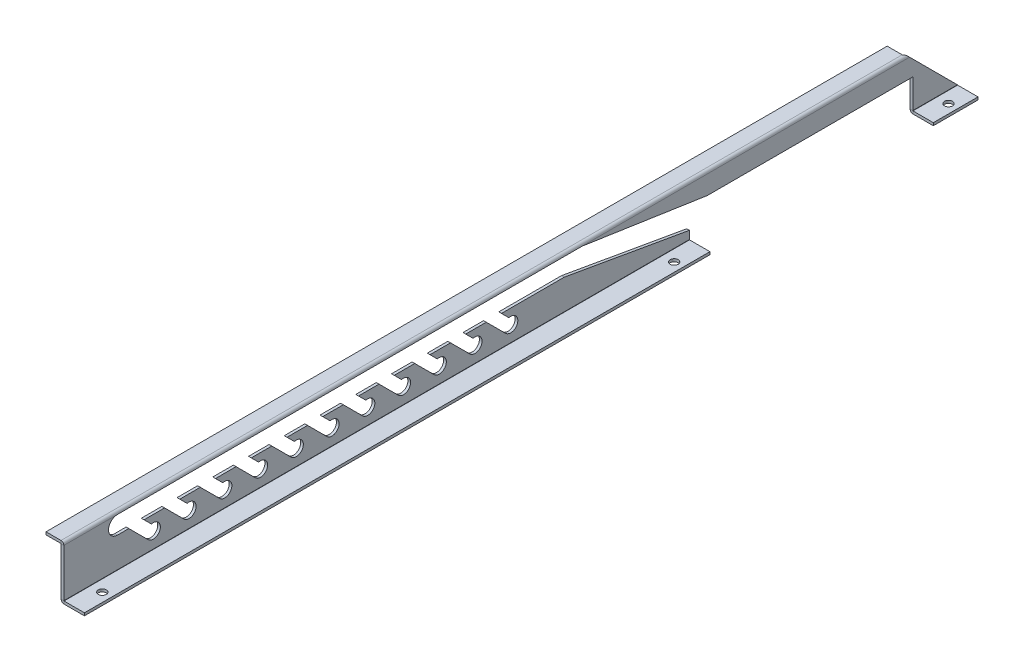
ISO-10303-21;
HEADER;
FILE_DESCRIPTION(('STEP AP214'),'2;1');
FILE_NAME('part.step','',(''),(''),'','','');
FILE_SCHEMA(('AUTOMOTIVE_DESIGN { 1 0 10303 214 1 1 1 1 }'));
ENDSEC;
DATA;
#1=APPLICATION_CONTEXT('core data for automotive mechanical design processes');
#2=APPLICATION_PROTOCOL_DEFINITION('international standard','automotive_design',2000,#1);
#3=PRODUCT_CONTEXT('',#1,'mechanical');
#4=PRODUCT('Part','Part','',(#3));
#5=PRODUCT_RELATED_PRODUCT_CATEGORY('part','',(#4));
#6=PRODUCT_DEFINITION_FORMATION('','',#4);
#7=PRODUCT_DEFINITION_CONTEXT('part definition',#1,'design');
#8=PRODUCT_DEFINITION('design','',#6,#7);
#9=PRODUCT_DEFINITION_SHAPE('','',#8);
#10=(LENGTH_UNIT() NAMED_UNIT(*) SI_UNIT(.MILLI.,.METRE.));
#11=(NAMED_UNIT(*) PLANE_ANGLE_UNIT() SI_UNIT($,.RADIAN.));
#12=(NAMED_UNIT(*) SI_UNIT($,.STERADIAN.) SOLID_ANGLE_UNIT());
#13=UNCERTAINTY_MEASURE_WITH_UNIT(LENGTH_MEASURE(1.E-05),#10,'distance_accuracy_value','');
#14=(GEOMETRIC_REPRESENTATION_CONTEXT(3) GLOBAL_UNCERTAINTY_ASSIGNED_CONTEXT((#13)) GLOBAL_UNIT_ASSIGNED_CONTEXT((#10,
#11,#12)) REPRESENTATION_CONTEXT('',''));
#15=CARTESIAN_POINT('',(0.,0.,0.));
#16=DIRECTION('',(0.,0.,1.));
#17=DIRECTION('',(1.,0.,0.));
#18=AXIS2_PLACEMENT_3D('',#15,#16,#17);
#19=CARTESIAN_POINT('',(-1.50000000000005,28.4999999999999,-500.));
#20=DIRECTION('',(-1.,0.,0.));
#21=DIRECTION('',(0.,-1.,0.));
#22=AXIS2_PLACEMENT_3D('',#19,#20,#21);
#23=PLANE('',#22);
#24=DIRECTION('',(0.,-1.,0.));
#25=VECTOR('',#24,1.);
#26=CARTESIAN_POINT('',(-1.50000000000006,-2.41327412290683,-475.));
#27=LINE('',#26,#25);
#28=CARTESIAN_POINT('',(-1.50000000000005,16.4132741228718,-475.));
#29=VERTEX_POINT('',#28);
#30=CARTESIAN_POINT('',(-1.49999999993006,0.100000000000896,-475.));
#31=VERTEX_POINT('',#30);
#32=EDGE_CURVE('E698',#29,#31,#27,.T.);
#33=ORIENTED_EDGE('',*,*,#32,.F.);
#34=DIRECTION('',(0.,0.,-1.));
#35=VECTOR('',#34,1.);
#36=CARTESIAN_POINT('',(-1.50000000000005,16.4132741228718,-475.));
#37=LINE('',#36,#35);
#38=CARTESIAN_POINT('',(-1.50000000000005,16.4132741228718,-360.));
#39=VERTEX_POINT('',#38);
#40=EDGE_CURVE('E695',#39,#29,#37,.T.);
#41=ORIENTED_EDGE('',*,*,#40,.F.);
#42=DIRECTION('',(0.,-0.148157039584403,-0.988963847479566));
#43=VECTOR('',#42,1.);
#44=CARTESIAN_POINT('',(-1.50000000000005,16.4132741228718,-360.));
#45=LINE('',#44,#43);
#46=CARTESIAN_POINT('',(-1.50000000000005,26.8999999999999,-290.));
#47=VERTEX_POINT('',#46);
#48=EDGE_CURVE('E689',#47,#39,#45,.T.);
#49=ORIENTED_EDGE('',*,*,#48,.F.);
#50=DIRECTION('',(0.,0.,1.));
#51=VECTOR('',#50,1.);
#52=CARTESIAN_POINT('',(-1.50000000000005,26.8999999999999,-500.));
#53=LINE('',#52,#51);
#54=CARTESIAN_POINT('',(-1.49999998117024,26.8999999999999,-473.2));
#55=VERTEX_POINT('',#54);
#56=EDGE_CURVE('E62',#55,#47,#53,.T.);
#57=ORIENTED_EDGE('',*,*,#56,.F.);
#58=DIRECTION('',(0.,0.707106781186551,0.707106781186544));
#59=VECTOR('',#58,1.);
#60=CARTESIAN_POINT('',(-1.50000000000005,14.3000000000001,-485.8));
#61=LINE('',#60,#59);
#62=CARTESIAN_POINT('',(-1.50000000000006,0.100000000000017,-500.));
#63=VERTEX_POINT('',#62);
#64=EDGE_CURVE('E710',#63,#55,#61,.T.);
#65=ORIENTED_EDGE('',*,*,#64,.F.);
#66=DIRECTION('',(0.,0.,1.));
#67=VECTOR('',#66,1.);
#68=CARTESIAN_POINT('',(-1.50000000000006,0.100000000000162,-500.));
#69=LINE('',#68,#67);
#70=EDGE_CURVE('E77',#63,#31,#69,.T.);
#71=ORIENTED_EDGE('',*,*,#70,.T.);
#72=EDGE_LOOP('',(#33,#41,#49,#57,#65,#71));
#73=FACE_BOUND('',#72,.T.);
#74=ADVANCED_FACE('F54',(#73),#23,.T.);
#75=CARTESIAN_POINT('',(0.,28.4999999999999,-500.));
#76=DIRECTION('',(-1.,0.,0.));
#77=DIRECTION('',(0.,-1.,0.));
#78=AXIS2_PLACEMENT_3D('',#75,#76,#77);
#79=PLANE('',#78);
#80=DIRECTION('',(0.,0.,-1.));
#81=VECTOR('',#80,1.);
#82=CARTESIAN_POINT('',(0.,16.4132741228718,-500.));
#83=LINE('',#82,#81);
#84=CARTESIAN_POINT('',(0.,16.4132741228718,-360.));
#85=VERTEX_POINT('',#84);
#86=CARTESIAN_POINT('',(0.,16.4132741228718,-475.));
#87=VERTEX_POINT('',#86);
#88=EDGE_CURVE('E748',#85,#87,#83,.T.);
#89=ORIENTED_EDGE('',*,*,#88,.T.);
#90=DIRECTION('',(0.,-1.,0.));
#91=VECTOR('',#90,1.);
#92=CARTESIAN_POINT('',(0.,28.4999999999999,-475.));
#93=LINE('',#92,#91);
#94=CARTESIAN_POINT('',(3.49435243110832E-11,0.100000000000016,-475.));
#95=VERTEX_POINT('',#94);
#96=EDGE_CURVE('E704',#87,#95,#93,.T.);
#97=ORIENTED_EDGE('',*,*,#96,.T.);
#98=DIRECTION('',(0.,0.,1.));
#99=VECTOR('',#98,1.);
#100=CARTESIAN_POINT('',(0.,0.0999999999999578,-500.));
#101=LINE('',#100,#99);
#102=CARTESIAN_POINT('',(3.49435243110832E-11,0.100000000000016,-500.));
#103=VERTEX_POINT('',#102);
#104=EDGE_CURVE('E756',#103,#95,#101,.T.);
#105=ORIENTED_EDGE('',*,*,#104,.F.);
#106=DIRECTION('',(0.,-0.707106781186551,-0.707106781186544));
#107=VECTOR('',#106,1.);
#108=CARTESIAN_POINT('',(0.,0.100000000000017,-500.));
#109=LINE('',#108,#107);
#110=CARTESIAN_POINT('',(1.88297595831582E-08,26.8999999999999,-473.2));
#111=VERTEX_POINT('',#110);
#112=EDGE_CURVE('E707',#111,#103,#109,.T.);
#113=ORIENTED_EDGE('',*,*,#112,.F.);
#114=DIRECTION('',(0.,0.,1.));
#115=VECTOR('',#114,1.);
#116=CARTESIAN_POINT('',(0.,26.8999999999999,-500.));
#117=LINE('',#116,#115);
#118=CARTESIAN_POINT('',(1.88297597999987E-08,26.8999999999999,-290.));
#119=VERTEX_POINT('',#118);
#120=EDGE_CURVE('E777',#111,#119,#117,.T.);
#121=ORIENTED_EDGE('',*,*,#120,.T.);
#122=DIRECTION('',(0.,-0.148157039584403,-0.988963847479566));
#123=VECTOR('',#122,1.);
#124=CARTESIAN_POINT('',(0.,-3.83448992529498,-495.155958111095));
#125=LINE('',#124,#123);
#126=EDGE_CURVE('E701',#119,#85,#125,.T.);
#127=ORIENTED_EDGE('',*,*,#126,.T.);
#128=EDGE_LOOP('',(#89,#97,#105,#113,#121,#127));
#129=FACE_BOUND('',#128,.T.);
#130=ADVANCED_FACE('F734',(#129),#79,.F.);
#131=CARTESIAN_POINT('',(-1.50005000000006,0.100000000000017,-500.));
#132=DIRECTION('',(0.,-0.707106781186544,0.707106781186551));
#133=DIRECTION('',(0.,-0.707106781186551,-0.707106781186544));
#134=AXIS2_PLACEMENT_3D('',#131,#132,#133);
#135=PLANE('',#134);
#136=CARTESIAN_POINT('',(1.88297595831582E-08,26.8999999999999,-473.2));
#137=CARTESIAN_POINT('',(-1.49999998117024,26.8999999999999,-473.2));
#138=B_SPLINE_CURVE_WITH_KNOTS('',1,(#136,#137),.UNSPECIFIED.,.F.,.F.,(2,2),(0.,1.),.UNSPECIFIED.);
#139=EDGE_CURVE('E717',#55,#111,#138,.F.);
#140=ORIENTED_EDGE('',*,*,#139,.T.);
#141=ORIENTED_EDGE('',*,*,#112,.T.);
#142=DIRECTION('',(-1.,1.36031232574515E-13,0.));
#143=VECTOR('',#142,1.);
#144=CARTESIAN_POINT('',(0.,0.0999999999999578,-500.));
#145=LINE('',#144,#143);
#146=EDGE_CURVE('E774',#103,#63,#145,.T.);
#147=ORIENTED_EDGE('',*,*,#146,.T.);
#148=ORIENTED_EDGE('',*,*,#64,.T.);
#149=EDGE_LOOP('',(#140,#141,#147,#148));
#150=FACE_BOUND('',#149,.T.);
#151=ADVANCED_FACE('F723',(#150),#135,.F.);
#152=CARTESIAN_POINT('',(-1.50000000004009,-2.41327412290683,-475.));
#153=DIRECTION('',(0.,0.,-1.));
#154=DIRECTION('',(1.35830067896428E-13,1.,0.));
#155=AXIS2_PLACEMENT_3D('',#152,#153,#154);
#156=PLANE('',#155);
#157=DIRECTION('',(-1.,0.,0.));
#158=VECTOR('',#157,1.);
#159=CARTESIAN_POINT('',(0.,0.100000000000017,-475.));
#160=LINE('',#159,#158);
#161=EDGE_CURVE('E759',#95,#31,#160,.T.);
#162=ORIENTED_EDGE('',*,*,#161,.F.);
#163=ORIENTED_EDGE('',*,*,#96,.F.);
#164=DIRECTION('',(-1.,0.,0.));
#165=VECTOR('',#164,1.);
#166=CARTESIAN_POINT('',(0.00377501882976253,16.4132741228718,-475.));
#167=LINE('',#166,#165);
#168=EDGE_CURVE('E699',#87,#29,#167,.T.);
#169=ORIENTED_EDGE('',*,*,#168,.T.);
#170=ORIENTED_EDGE('',*,*,#32,.T.);
#171=EDGE_LOOP('',(#162,#163,#169,#170));
#172=FACE_BOUND('',#171,.T.);
#173=ADVANCED_FACE('F733',(#172),#156,.F.);
#174=CARTESIAN_POINT('',(0.00377501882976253,16.4132741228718,-475.));
#175=DIRECTION('',(0.,1.,0.));
#176=DIRECTION('',(-1.,0.,0.));
#177=AXIS2_PLACEMENT_3D('',#174,#175,#176);
#178=PLANE('',#177);
#179=DIRECTION('',(-1.,0.,0.));
#180=VECTOR('',#179,1.);
#181=CARTESIAN_POINT('',(0.00377501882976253,16.4132741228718,-360.));
#182=LINE('',#181,#180);
#183=EDGE_CURVE('E702',#85,#39,#182,.T.);
#184=ORIENTED_EDGE('',*,*,#183,.T.);
#185=ORIENTED_EDGE('',*,*,#40,.T.);
#186=ORIENTED_EDGE('',*,*,#168,.F.);
#187=ORIENTED_EDGE('',*,*,#88,.F.);
#188=EDGE_LOOP('',(#184,#185,#186,#187));
#189=FACE_BOUND('',#188,.T.);
#190=ADVANCED_FACE('F738',(#189),#178,.F.);
#191=CARTESIAN_POINT('',(0.00377501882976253,16.4132741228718,-360.));
#192=DIRECTION('',(0.,0.988963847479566,-0.148157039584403));
#193=DIRECTION('',(0.,0.148157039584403,0.988963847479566));
#194=AXIS2_PLACEMENT_3D('',#191,#192,#193);
#195=PLANE('',#194);
#196=DIRECTION('',(-1.,0.,0.));
#197=VECTOR('',#196,1.);
#198=CARTESIAN_POINT('',(0.0037750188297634,26.8999999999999,-290.));
#199=LINE('',#198,#197);
#200=EDGE_CURVE('E12',#119,#47,#199,.T.);
#201=ORIENTED_EDGE('',*,*,#200,.T.);
#202=ORIENTED_EDGE('',*,*,#48,.T.);
#203=ORIENTED_EDGE('',*,*,#183,.F.);
#204=ORIENTED_EDGE('',*,*,#126,.F.);
#205=EDGE_LOOP('',(#201,#202,#203,#204));
#206=FACE_BOUND('',#205,.T.);
#207=ADVANCED_FACE('F735',(#206),#195,.F.);
#208=CARTESIAN_POINT('',(0.0999999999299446,0.0999999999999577,-475.));
#209=DIRECTION('',(0.,0.,-1.));
#210=DIRECTION('',(-1.,0.,0.));
#211=AXIS2_PLACEMENT_3D('',#208,#209,#210);
#212=PLANE('',#211);
#213=ORIENTED_EDGE('',*,*,#161,.T.);
#214=CARTESIAN_POINT('',(0.0999999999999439,0.0999999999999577,-475.));
#215=DIRECTION('',(0.,0.,-1.));
#216=DIRECTION('',(-1.,0.,0.));
#217=AXIS2_PLACEMENT_3D('',#214,#215,#216);
#218=CIRCLE('',#217,1.59999999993);
#219=CARTESIAN_POINT('',(0.100000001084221,-1.49999999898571,-475.));
#220=VERTEX_POINT('',#219);
#221=EDGE_CURVE('E642',#31,#220,#218,.F.);
#222=ORIENTED_EDGE('',*,*,#221,.T.);
#223=DIRECTION('',(-1.35830067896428E-13,1.,0.));
#224=VECTOR('',#223,1.);
#225=CARTESIAN_POINT('',(0.100000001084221,-1.49999999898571,-475.));
#226=LINE('',#225,#224);
#227=CARTESIAN_POINT('',(0.100000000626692,1.11927679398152E-09,-475.));
#228=VERTEX_POINT('',#227);
#229=EDGE_CURVE('E677',#220,#228,#226,.T.);
#230=ORIENTED_EDGE('',*,*,#229,.T.);
#231=CARTESIAN_POINT('',(0.0999999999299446,0.0999999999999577,-475.));
#232=DIRECTION('',(0.,0.,1.));
#233=DIRECTION('',(1.,0.,0.));
#234=AXIS2_PLACEMENT_3D('',#231,#232,#233);
#235=CIRCLE('',#234,0.0999999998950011);
#236=EDGE_CURVE('E690',#95,#228,#235,.T.);
#237=ORIENTED_EDGE('',*,*,#236,.F.);
#238=EDGE_LOOP('',(#213,#222,#230,#237));
#239=FACE_BOUND('',#238,.T.);
#240=ADVANCED_FACE('F1349',(#239),#212,.F.);
#241=CARTESIAN_POINT('',(0.0999999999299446,0.0999999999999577,-500.));
#242=DIRECTION('',(0.,0.,1.));
#243=DIRECTION('',(1.,0.,0.));
#244=AXIS2_PLACEMENT_3D('',#241,#242,#243);
#245=PLANE('',#244);
#246=DIRECTION('',(0.,1.,0.));
#247=VECTOR('',#246,1.);
#248=CARTESIAN_POINT('',(0.100000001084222,-1.49999999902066,-500.));
#249=LINE('',#248,#247);
#250=CARTESIAN_POINT('',(0.100000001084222,-1.49999999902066,-500.));
#251=VERTEX_POINT('',#250);
#252=CARTESIAN_POINT('',(0.100000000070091,6.99570474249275E-11,-500.));
#253=VERTEX_POINT('',#252);
#254=EDGE_CURVE('E645',#251,#253,#249,.T.);
#255=ORIENTED_EDGE('',*,*,#254,.F.);
#256=CARTESIAN_POINT('',(0.0999999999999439,0.0999999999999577,-500.));
#257=DIRECTION('',(0.,0.,-1.));
#258=DIRECTION('',(-1.,0.,0.));
#259=AXIS2_PLACEMENT_3D('',#256,#257,#258);
#260=CIRCLE('',#259,1.59999999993);
#261=EDGE_CURVE('E691',#251,#63,#260,.T.);
#262=ORIENTED_EDGE('',*,*,#261,.T.);
#263=ORIENTED_EDGE('',*,*,#146,.F.);
#264=CARTESIAN_POINT('',(0.0999999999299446,0.0999999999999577,-500.));
#265=DIRECTION('',(0.,0.,-1.));
#266=DIRECTION('',(-1.,0.,0.));
#267=AXIS2_PLACEMENT_3D('',#264,#265,#266);
#268=CIRCLE('',#267,0.0999999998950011);
#269=EDGE_CURVE('E686',#253,#103,#268,.T.);
#270=ORIENTED_EDGE('',*,*,#269,.F.);
#271=EDGE_LOOP('',(#255,#262,#263,#270));
#272=FACE_BOUND('',#271,.T.);
#273=ADVANCED_FACE('F1343',(#272),#245,.F.);
#274=CARTESIAN_POINT('',(0.0999999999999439,0.0999999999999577,-462.329252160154));
#275=DIRECTION('',(0.,0.,-1.));
#276=DIRECTION('',(-1.,0.,0.));
#277=AXIS2_PLACEMENT_3D('',#274,#275,#276);
#278=CYLINDRICAL_SURFACE('',#277,0.0999999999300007);
#279=ORIENTED_EDGE('',*,*,#269,.T.);
#280=ORIENTED_EDGE('',*,*,#104,.T.);
#281=ORIENTED_EDGE('',*,*,#236,.T.);
#282=DIRECTION('',(0.,0.,1.));
#283=VECTOR('',#282,1.);
#284=CARTESIAN_POINT('',(0.100000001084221,9.7933748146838E-10,-500.));
#285=LINE('',#284,#283);
#286=EDGE_CURVE('E667',#253,#228,#285,.T.);
#287=ORIENTED_EDGE('',*,*,#286,.F.);
#288=EDGE_LOOP('',(#279,#280,#281,#287));
#289=FACE_BOUND('',#288,.T.);
#290=ADVANCED_FACE('F1340',(#289),#278,.F.);
#291=CARTESIAN_POINT('',(0.0999999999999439,0.0999999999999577,-462.329252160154));
#292=DIRECTION('',(0.,0.,-1.));
#293=DIRECTION('',(-1.,0.,0.));
#294=AXIS2_PLACEMENT_3D('',#291,#292,#293);
#295=CYLINDRICAL_SURFACE('',#294,1.59999999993);
#296=ORIENTED_EDGE('',*,*,#261,.F.);
#297=DIRECTION('',(0.,0.,1.));
#298=VECTOR('',#297,1.);
#299=CARTESIAN_POINT('',(0.100000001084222,-1.49999999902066,-500.));
#300=LINE('',#299,#298);
#301=EDGE_CURVE('E680',#251,#220,#300,.T.);
#302=ORIENTED_EDGE('',*,*,#301,.T.);
#303=ORIENTED_EDGE('',*,*,#221,.F.);
#304=ORIENTED_EDGE('',*,*,#70,.F.);
#305=EDGE_LOOP('',(#296,#302,#303,#304));
#306=FACE_BOUND('',#305,.T.);
#307=ADVANCED_FACE('F1319',(#306),#295,.T.);
#308=CARTESIAN_POINT('',(11.5000000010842,9.7933748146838E-10,-500.));
#309=DIRECTION('',(-1.,0.,0.));
#310=DIRECTION('',(0.,0.,1.));
#311=AXIS2_PLACEMENT_3D('',#308,#309,#310);
#312=PLANE('',#311);
#313=DIRECTION('',(0.,0.,1.));
#314=VECTOR('',#313,1.);
#315=CARTESIAN_POINT('',(11.5000000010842,9.7933748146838E-10,-500.));
#316=LINE('',#315,#314);
#317=CARTESIAN_POINT('',(11.5000000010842,9.7933748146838E-10,-500.));
#318=VERTEX_POINT('',#317);
#319=CARTESIAN_POINT('',(11.5000000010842,9.7933748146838E-10,-475.));
#320=VERTEX_POINT('',#319);
#321=EDGE_CURVE('E674',#318,#320,#316,.T.);
#322=ORIENTED_EDGE('',*,*,#321,.T.);
#323=DIRECTION('',(0.,1.,0.));
#324=VECTOR('',#323,1.);
#325=CARTESIAN_POINT('',(11.5000000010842,-1.49999999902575,-475.));
#326=LINE('',#325,#324);
#327=CARTESIAN_POINT('',(11.5000000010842,-1.49999999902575,-475.));
#328=VERTEX_POINT('',#327);
#329=EDGE_CURVE('E663',#328,#320,#326,.T.);
#330=ORIENTED_EDGE('',*,*,#329,.F.);
#331=DIRECTION('',(0.,0.,1.));
#332=VECTOR('',#331,1.);
#333=CARTESIAN_POINT('',(11.5000000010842,-1.49999999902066,-500.));
#334=LINE('',#333,#332);
#335=CARTESIAN_POINT('',(11.5000000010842,-1.49999999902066,-500.));
#336=VERTEX_POINT('',#335);
#337=EDGE_CURVE('E647',#336,#328,#334,.T.);
#338=ORIENTED_EDGE('',*,*,#337,.F.);
#339=DIRECTION('',(0.,-1.,0.));
#340=VECTOR('',#339,1.);
#341=CARTESIAN_POINT('',(11.5000000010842,9.7933748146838E-10,-500.));
#342=LINE('',#341,#340);
#343=EDGE_CURVE('E639',#318,#336,#342,.T.);
#344=ORIENTED_EDGE('',*,*,#343,.F.);
#345=EDGE_LOOP('',(#322,#330,#338,#344));
#346=FACE_BOUND('',#345,.T.);
#347=ADVANCED_FACE('F1315',(#346),#312,.F.);
#348=CARTESIAN_POINT('',(6.50000000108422,-1.49999999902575,-488.5));
#349=DIRECTION('',(0.,1.,0.));
#350=DIRECTION('',(0.,0.,1.));
#351=AXIS2_PLACEMENT_3D('',#348,#349,#350);
#352=CYLINDRICAL_SURFACE('',#351,2.25);
#353=CARTESIAN_POINT('',(6.50000000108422,-1.49999999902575,-488.5));
#354=DIRECTION('',(0.,1.,0.));
#355=DIRECTION('',(0.,0.,1.));
#356=AXIS2_PLACEMENT_3D('',#353,#354,#355);
#357=CIRCLE('',#356,2.25);
#358=CARTESIAN_POINT('',(6.50000000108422,-1.49999999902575,-486.25));
#359=VERTEX_POINT('',#358);
#360=EDGE_CURVE('E655',#359,#359,#357,.T.);
#361=ORIENTED_EDGE('',*,*,#360,.F.);
#362=EDGE_LOOP('',(#361));
#363=FACE_BOUND('',#362,.T.);
#364=CARTESIAN_POINT('',(6.50000000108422,9.7933748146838E-10,-488.5));
#365=DIRECTION('',(0.,1.,0.));
#366=DIRECTION('',(0.,0.,1.));
#367=AXIS2_PLACEMENT_3D('',#364,#365,#366);
#368=CIRCLE('',#367,2.25);
#369=CARTESIAN_POINT('',(6.50000000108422,9.7933748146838E-10,-486.25));
#370=VERTEX_POINT('',#369);
#371=EDGE_CURVE('E669',#370,#370,#368,.T.);
#372=ORIENTED_EDGE('',*,*,#371,.T.);
#373=EDGE_LOOP('',(#372));
#374=FACE_BOUND('',#373,.T.);
#375=ADVANCED_FACE('F1318',(#363,#374),#352,.F.);
#376=CARTESIAN_POINT('',(1.08422125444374E-09,9.7933748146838E-10,-500.));
#377=DIRECTION('',(0.,-1.,0.));
#378=DIRECTION('',(0.,0.,-1.));
#379=AXIS2_PLACEMENT_3D('',#376,#377,#378);
#380=PLANE('',#379);
#381=ORIENTED_EDGE('',*,*,#371,.F.);
#382=EDGE_LOOP('',(#381));
#383=FACE_BOUND('',#382,.T.);
#384=ORIENTED_EDGE('',*,*,#286,.T.);
#385=DIRECTION('',(-1.,0.,0.));
#386=VECTOR('',#385,1.);
#387=CARTESIAN_POINT('',(0.100000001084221,9.7933748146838E-10,-475.));
#388=LINE('',#387,#386);
#389=EDGE_CURVE('E660',#320,#228,#388,.T.);
#390=ORIENTED_EDGE('',*,*,#389,.F.);
#391=ORIENTED_EDGE('',*,*,#321,.F.);
#392=DIRECTION('',(1.,0.,0.));
#393=VECTOR('',#392,1.);
#394=CARTESIAN_POINT('',(1.08422125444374E-09,9.7933748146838E-10,-500.));
#395=LINE('',#394,#393);
#396=EDGE_CURVE('E643',#253,#318,#395,.T.);
#397=ORIENTED_EDGE('',*,*,#396,.F.);
#398=EDGE_LOOP('',(#384,#390,#391,#397));
#399=FACE_BOUND('',#398,.T.);
#400=ADVANCED_FACE('F1323',(#383,#399),#380,.F.);
#401=CARTESIAN_POINT('',(0.100000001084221,-1.49999999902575,-475.));
#402=DIRECTION('',(0.,0.,-1.));
#403=DIRECTION('',(-1.,0.,0.));
#404=AXIS2_PLACEMENT_3D('',#401,#402,#403);
#405=PLANE('',#404);
#406=ORIENTED_EDGE('',*,*,#229,.F.);
#407=DIRECTION('',(-1.,0.,0.));
#408=VECTOR('',#407,1.);
#409=CARTESIAN_POINT('',(0.100000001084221,-1.49999999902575,-475.));
#410=LINE('',#409,#408);
#411=EDGE_CURVE('E653',#328,#220,#410,.T.);
#412=ORIENTED_EDGE('',*,*,#411,.F.);
#413=ORIENTED_EDGE('',*,*,#329,.T.);
#414=ORIENTED_EDGE('',*,*,#389,.T.);
#415=EDGE_LOOP('',(#406,#412,#413,#414));
#416=FACE_BOUND('',#415,.T.);
#417=ADVANCED_FACE('F1327',(#416),#405,.F.);
#418=CARTESIAN_POINT('',(1.08422125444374E-09,-1.49999999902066,-500.));
#419=DIRECTION('',(0.,-1.,0.));
#420=DIRECTION('',(0.,0.,-1.));
#421=AXIS2_PLACEMENT_3D('',#418,#419,#420);
#422=PLANE('',#421);
#423=ORIENTED_EDGE('',*,*,#360,.T.);
#424=EDGE_LOOP('',(#423));
#425=FACE_BOUND('',#424,.T.);
#426=ORIENTED_EDGE('',*,*,#411,.T.);
#427=ORIENTED_EDGE('',*,*,#301,.F.);
#428=DIRECTION('',(1.,0.,0.));
#429=VECTOR('',#428,1.);
#430=CARTESIAN_POINT('',(1.08422125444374E-09,-1.49999999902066,-500.));
#431=LINE('',#430,#429);
#432=EDGE_CURVE('E650',#251,#336,#431,.T.);
#433=ORIENTED_EDGE('',*,*,#432,.T.);
#434=ORIENTED_EDGE('',*,*,#337,.T.);
#435=EDGE_LOOP('',(#426,#427,#433,#434));
#436=FACE_BOUND('',#435,.T.);
#437=ADVANCED_FACE('F1331',(#425,#436),#422,.T.);
#438=CARTESIAN_POINT('',(0.100000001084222,0.100000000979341,-500.));
#439=DIRECTION('',(0.,0.,-1.));
#440=DIRECTION('',(-1.,0.,0.));
#441=AXIS2_PLACEMENT_3D('',#438,#439,#440);
#442=PLANE('',#441);
#443=ORIENTED_EDGE('',*,*,#432,.F.);
#444=ORIENTED_EDGE('',*,*,#254,.T.);
#445=ORIENTED_EDGE('',*,*,#396,.T.);
#446=ORIENTED_EDGE('',*,*,#343,.T.);
#447=EDGE_LOOP('',(#443,#444,#445,#446));
#448=FACE_BOUND('',#447,.T.);
#449=ADVANCED_FACE('F1335',(#448),#442,.T.);
#450=CARTESIAN_POINT('',(1.88297597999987E-08,26.8999999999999,-236.599999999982));
#451=DIRECTION('',(0.,-1.,0.));
#452=DIRECTION('',(0.,0.,-1.));
#453=AXIS2_PLACEMENT_3D('',#450,#451,#452);
#454=PLANE('',#453);
#455=ORIENTED_EDGE('',*,*,#200,.F.);
#456=DIRECTION('',(0.,0.,-1.));
#457=VECTOR('',#456,1.);
#458=CARTESIAN_POINT('',(1.88297597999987E-08,26.8999999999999,-473.2));
#459=LINE('',#458,#457);
#460=CARTESIAN_POINT('',(0.,26.8999999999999,-30.));
#461=VERTEX_POINT('',#460);
#462=EDGE_CURVE('E583',#461,#119,#459,.T.);
#463=ORIENTED_EDGE('',*,*,#462,.F.);
#464=DIRECTION('',(-1.,0.,0.));
#465=VECTOR('',#464,1.);
#466=CARTESIAN_POINT('',(0.0037750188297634,26.8999999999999,-30.));
#467=LINE('',#466,#465);
#468=CARTESIAN_POINT('',(-1.49999998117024,26.8999999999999,-30.));
#469=VERTEX_POINT('',#468);
#470=EDGE_CURVE('E574',#461,#469,#467,.T.);
#471=ORIENTED_EDGE('',*,*,#470,.T.);
#472=DIRECTION('',(0.,0.,1.));
#473=VECTOR('',#472,1.);
#474=CARTESIAN_POINT('',(-1.49999998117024,26.8999999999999,-236.599999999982));
#475=LINE('',#474,#473);
#476=EDGE_CURVE('E69',#469,#47,#475,.F.);
#477=ORIENTED_EDGE('',*,*,#476,.T.);
#478=EDGE_LOOP('',(#455,#463,#471,#477));
#479=FACE_BOUND('',#478,.T.);
#480=ADVANCED_FACE('F797',(#479),#454,.T.);
#481=CARTESIAN_POINT('',(-9.99999994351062,26.9999999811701,-499.99999999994));
#482=DIRECTION('',(1.,0.,0.));
#483=DIRECTION('',(0.,0.,-1.));
#484=AXIS2_PLACEMENT_3D('',#481,#482,#483);
#485=PLANE('',#484);
#486=DIRECTION('',(0.,0.,1.));
#487=VECTOR('',#486,1.);
#488=CARTESIAN_POINT('',(-9.99999994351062,28.4999999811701,-499.99999999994));
#489=LINE('',#488,#487);
#490=CARTESIAN_POINT('',(-9.99999994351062,28.4999999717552,-470.686725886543));
#491=VERTEX_POINT('',#490);
#492=CARTESIAN_POINT('',(-9.99999994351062,28.4999999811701,6.03406213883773E-11));
#493=VERTEX_POINT('',#492);
#494=EDGE_CURVE('E2284',#491,#493,#489,.T.);
#495=ORIENTED_EDGE('',*,*,#494,.F.);
#496=DIRECTION('',(0.,1.,0.));
#497=VECTOR('',#496,1.);
#498=CARTESIAN_POINT('',(-9.99999994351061,26.9999499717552,-470.686725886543));
#499=LINE('',#498,#497);
#500=CARTESIAN_POINT('',(-9.99999994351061,26.9999999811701,-470.686725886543));
#501=VERTEX_POINT('',#500);
#502=EDGE_CURVE('E2274',#501,#491,#499,.T.);
#503=ORIENTED_EDGE('',*,*,#502,.F.);
#504=DIRECTION('',(0.,0.,1.));
#505=VECTOR('',#504,1.);
#506=CARTESIAN_POINT('',(-9.99999994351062,26.9999999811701,-499.99999999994));
#507=LINE('',#506,#505);
#508=CARTESIAN_POINT('',(-9.99999994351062,26.9999999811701,6.03406213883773E-11));
#509=VERTEX_POINT('',#508);
#510=EDGE_CURVE('E2289',#501,#509,#507,.T.);
#511=ORIENTED_EDGE('',*,*,#510,.T.);
#512=DIRECTION('',(0.,1.,0.));
#513=VECTOR('',#512,1.);
#514=CARTESIAN_POINT('',(-9.99999994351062,26.9999999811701,6.03406213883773E-11));
#515=LINE('',#514,#513);
#516=EDGE_CURVE('E2286',#509,#493,#515,.T.);
#517=ORIENTED_EDGE('',*,*,#516,.T.);
#518=EDGE_LOOP('',(#495,#503,#511,#517));
#519=FACE_BOUND('',#518,.T.);
#520=ADVANCED_FACE('F1420',(#519),#485,.F.);
#521=CARTESIAN_POINT('',(-9.99999994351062,28.4999999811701,-499.99999999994));
#522=DIRECTION('',(0.,-1.,0.));
#523=DIRECTION('',(0.,0.,-1.));
#524=AXIS2_PLACEMENT_3D('',#521,#522,#523);
#525=PLANE('',#524);
#526=DIRECTION('',(0.,0.,1.));
#527=VECTOR('',#526,1.);
#528=CARTESIAN_POINT('',(-1.59999994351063,28.4999999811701,-499.99999999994));
#529=LINE('',#528,#527);
#530=CARTESIAN_POINT('',(-1.59999994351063,28.5000000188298,-470.686725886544));
#531=VERTEX_POINT('',#530);
#532=CARTESIAN_POINT('',(-1.59999996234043,28.5000000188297,6.0285110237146E-11));
#533=VERTEX_POINT('',#532);
#534=EDGE_CURVE('E638',#531,#533,#529,.T.);
#535=ORIENTED_EDGE('',*,*,#534,.F.);
#536=DIRECTION('',(1.,0.,0.));
#537=VECTOR('',#536,1.);
#538=CARTESIAN_POINT('',(-1.59999993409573,28.4999999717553,-470.686725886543));
#539=LINE('',#538,#537);
#540=EDGE_CURVE('E2268',#491,#531,#539,.T.);
#541=ORIENTED_EDGE('',*,*,#540,.F.);
#542=ORIENTED_EDGE('',*,*,#494,.T.);
#543=DIRECTION('',(1.,0.,0.));
#544=VECTOR('',#543,1.);
#545=CARTESIAN_POINT('',(-9.99999994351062,28.4999999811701,6.03406213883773E-11));
#546=LINE('',#545,#544);
#547=EDGE_CURVE('E2280',#493,#533,#546,.T.);
#548=ORIENTED_EDGE('',*,*,#547,.T.);
#549=EDGE_LOOP('',(#535,#541,#542,#548));
#550=FACE_BOUND('',#549,.T.);
#551=ADVANCED_FACE('F1308',(#550),#525,.F.);
#552=CARTESIAN_POINT('',(-1.59999993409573,26.9999499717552,-470.686725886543));
#553=DIRECTION('',(0.,0.,1.));
#554=DIRECTION('',(1.,0.,0.));
#555=AXIS2_PLACEMENT_3D('',#552,#553,#554);
#556=PLANE('',#555);
#557=DIRECTION('',(-1.,0.,0.));
#558=VECTOR('',#557,1.);
#559=CARTESIAN_POINT('',(-9.99999994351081,26.9999999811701,-470.686725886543));
#560=LINE('',#559,#558);
#561=CARTESIAN_POINT('',(-1.59999994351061,26.9999999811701,-470.686725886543));
#562=VERTEX_POINT('',#561);
#563=EDGE_CURVE('E2278',#562,#501,#560,.T.);
#564=ORIENTED_EDGE('',*,*,#563,.T.);
#565=ORIENTED_EDGE('',*,*,#502,.T.);
#566=ORIENTED_EDGE('',*,*,#540,.T.);
#567=CARTESIAN_POINT('',(-1.59999999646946,27.0000000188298,-470.686725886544));
#568=CARTESIAN_POINT('',(-1.59999994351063,28.5000000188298,-470.686725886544));
#569=B_SPLINE_CURVE_WITH_KNOTS('',1,(#567,#568),.UNSPECIFIED.,.F.,.F.,(2,2),(0.,1.),.UNSPECIFIED.);
#570=EDGE_CURVE('E1245',#562,#531,#569,.T.);
#571=ORIENTED_EDGE('',*,*,#570,.F.);
#572=EDGE_LOOP('',(#564,#565,#566,#571));
#573=FACE_BOUND('',#572,.T.);
#574=ADVANCED_FACE('F1297',(#573),#556,.F.);
#575=CARTESIAN_POINT('',(-9.99999994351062,26.9999999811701,-499.99999999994));
#576=DIRECTION('',(0.,-1.,0.));
#577=DIRECTION('',(0.,0.,-1.));
#578=AXIS2_PLACEMENT_3D('',#575,#576,#577);
#579=PLANE('',#578);
#580=ORIENTED_EDGE('',*,*,#563,.F.);
#581=DIRECTION('',(0.,0.,1.));
#582=VECTOR('',#581,1.);
#583=CARTESIAN_POINT('',(-1.59999994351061,26.9999999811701,-499.99999999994));
#584=LINE('',#583,#582);
#585=CARTESIAN_POINT('',(-1.59999994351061,26.9999999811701,6.03406213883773E-11));
#586=VERTEX_POINT('',#585);
#587=EDGE_CURVE('E2261',#562,#586,#584,.T.);
#588=ORIENTED_EDGE('',*,*,#587,.T.);
#589=DIRECTION('',(1.,0.,0.));
#590=VECTOR('',#589,1.);
#591=CARTESIAN_POINT('',(-9.99999994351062,26.9999999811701,6.03406213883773E-11));
#592=LINE('',#591,#590);
#593=EDGE_CURVE('E2265',#509,#586,#592,.T.);
#594=ORIENTED_EDGE('',*,*,#593,.F.);
#595=ORIENTED_EDGE('',*,*,#510,.F.);
#596=EDGE_LOOP('',(#580,#588,#594,#595));
#597=FACE_BOUND('',#596,.T.);
#598=ADVANCED_FACE('F1307',(#597),#579,.T.);
#599=CARTESIAN_POINT('',(0.100000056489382,0.0999999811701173,6.03406213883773E-11));
#600=DIRECTION('',(0.,0.,-1.));
#601=DIRECTION('',(-1.,0.,0.));
#602=AXIS2_PLACEMENT_3D('',#599,#600,#601);
#603=PLANE('',#602);
#604=ORIENTED_EDGE('',*,*,#593,.T.);
#605=DIRECTION('',(0.,1.,0.));
#606=VECTOR('',#605,1.);
#607=CARTESIAN_POINT('',(-1.59999994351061,26.9999999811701,6.03406213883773E-11));
#608=LINE('',#607,#606);
#609=EDGE_CURVE('E685',#586,#533,#608,.T.);
#610=ORIENTED_EDGE('',*,*,#609,.T.);
#611=ORIENTED_EDGE('',*,*,#547,.F.);
#612=ORIENTED_EDGE('',*,*,#516,.F.);
#613=EDGE_LOOP('',(#604,#610,#611,#612));
#614=FACE_BOUND('',#613,.T.);
#615=ADVANCED_FACE('F1264',(#614),#603,.F.);
#616=CARTESIAN_POINT('',(1.88297595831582E-08,26.8999999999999,-473.2));
#617=CARTESIAN_POINT('',(1.88297595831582E-08,27.1094583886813,-472.990541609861));
#618=CARTESIAN_POINT('',(-0.0416436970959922,27.3187966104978,-472.781120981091));
#619=CARTESIAN_POINT('',(-0.201941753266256,27.7057903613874,-472.362241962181));
#620=CARTESIAN_POINT('',(-0.320533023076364,27.8832747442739,-472.152802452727));
#621=CARTESIAN_POINT('',(-0.616725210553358,28.1794669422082,-471.733923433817));
#622=CARTESIAN_POINT('',(-0.794209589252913,28.2980582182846,-471.524483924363));
#623=CARTESIAN_POINT('',(-1.18120333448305,28.458356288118,-471.105604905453));
#624=CARTESIAN_POINT('',(-1.39054155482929,28.5000000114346,-470.896184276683));
#625=CARTESIAN_POINT('',(-1.59999994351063,28.5000000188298,-470.686725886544));
#626=CARTESIAN_POINT('',(-1.49999998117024,26.8999999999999,-473.2));
#627=CARTESIAN_POINT('',(-1.49999998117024,26.9130899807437,-472.990560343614));
#628=CARTESIAN_POINT('',(-1.50260271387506,26.9261747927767,-472.781120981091));
#629=CARTESIAN_POINT('',(-1.51262134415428,26.950361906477,-472.362241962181));
#630=CARTESIAN_POINT('',(-1.52003329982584,26.9614546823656,-472.152802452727));
#631=CARTESIAN_POINT('',(-1.53854531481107,26.9799666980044,-471.733923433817));
#632=CARTESIAN_POINT('',(-1.549638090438,26.9873786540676,-471.524483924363));
#633=CARTESIAN_POINT('',(-1.57382520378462,26.9973972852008,-471.105604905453));
#634=CARTESIAN_POINT('',(-1.58691001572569,27.0000000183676,-470.89616554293));
#635=CARTESIAN_POINT('',(-1.59999999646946,27.0000000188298,-470.686725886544));
#636=B_SPLINE_SURFACE_WITH_KNOTS('',1,3,((#616,#617,#618,#619,#620,#621,#622,#623,#624,#625),
(#626,#627,#628,#629,#630,#631,#632,#633,#634,#635)),.UNSPECIFIED.,.F.,.F.,.F.,(2,2),(4,2,2,2,
4),(0.,1.),(0.,0.25,0.5,0.75,1.),.UNSPECIFIED.);
#637=CARTESIAN_POINT('',(-1.49999998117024,26.8999999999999,-473.2));
#638=CARTESIAN_POINT('',(-1.49999998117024,26.9130899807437,-472.990560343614));
#639=CARTESIAN_POINT('',(-1.50260271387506,26.9261747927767,-472.781120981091));
#640=CARTESIAN_POINT('',(-1.51262134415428,26.950361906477,-472.362241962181));
#641=CARTESIAN_POINT('',(-1.52003329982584,26.9614546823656,-472.152802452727));
#642=CARTESIAN_POINT('',(-1.53854531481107,26.9799666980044,-471.733923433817));
#643=CARTESIAN_POINT('',(-1.549638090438,26.9873786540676,-471.524483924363));
#644=CARTESIAN_POINT('',(-1.57382520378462,26.9973972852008,-471.105604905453));
#645=CARTESIAN_POINT('',(-1.58691001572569,27.0000000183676,-470.89616554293));
#646=CARTESIAN_POINT('',(-1.59999999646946,27.0000000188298,-470.686725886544));
#647=B_SPLINE_CURVE_WITH_KNOTS('',3,(#637,#638,#639,#640,#641,#642,#643,#644,#645,#646),
.UNSPECIFIED.,.F.,.F.,(4,2,2,2,4),(0.,0.25,0.5,0.75,1.),.UNSPECIFIED.);
#648=EDGE_CURVE('E588',#55,#562,#647,.T.);
#649=CARTESIAN_POINT('',(-1.59999994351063,28.5000000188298,-470.686725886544));
#650=CARTESIAN_POINT('',(-1.39054155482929,28.5000000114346,-470.896184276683));
#651=CARTESIAN_POINT('',(-1.18120333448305,28.458356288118,-471.105604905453));
#652=CARTESIAN_POINT('',(-0.794209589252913,28.2980582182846,-471.524483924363));
#653=CARTESIAN_POINT('',(-0.616725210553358,28.1794669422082,-471.733923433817));
#654=CARTESIAN_POINT('',(-0.320533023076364,27.8832747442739,-472.152802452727));
#655=CARTESIAN_POINT('',(-0.201941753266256,27.7057903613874,-472.362241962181));
#656=CARTESIAN_POINT('',(-0.0416436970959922,27.3187966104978,-472.781120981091));
#657=CARTESIAN_POINT('',(1.88297595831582E-08,27.1094583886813,-472.990541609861));
#658=CARTESIAN_POINT('',(1.88297595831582E-08,26.8999999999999,-473.2));
#659=B_SPLINE_CURVE_WITH_KNOTS('',3,(#649,#650,#651,#652,#653,#654,#655,#656,#657,#658),
.UNSPECIFIED.,.F.,.F.,(4,2,2,2,4),(0.,0.25,0.5,0.75,1.),.UNSPECIFIED.);
#660=EDGE_CURVE('E584',#111,#531,#659,.F.);
#661=ORIENTED_EDGE('',*,*,#139,.F.);
#662=ORIENTED_EDGE('',*,*,#648,.T.);
#663=ORIENTED_EDGE('',*,*,#570,.T.);
#664=ORIENTED_EDGE('',*,*,#660,.F.);
#665=EDGE_LOOP('',(#661,#662,#663,#664));
#666=FACE_BOUND('',#665,.T.);
#667=ADVANCED_FACE('F1243',(#666),#636,.T.);
#668=CARTESIAN_POINT('',(-1.60000001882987,26.8999999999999,6.0285110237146E-11));
#669=DIRECTION('',(1.5524793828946E-11,0.,1.));
#670=DIRECTION('',(1.,0.,-1.5524793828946E-11));
#671=AXIS2_PLACEMENT_3D('',#668,#669,#670);
#672=PLANE('',#671);
#673=ORIENTED_EDGE('',*,*,#609,.F.);
#674=CARTESIAN_POINT('',(-1.60000001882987,26.8999999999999,6.0285110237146E-11));
#675=DIRECTION('',(-1.5524793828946E-11,0.,-1.));
#676=DIRECTION('',(-1.,0.,1.5524793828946E-11));
#677=AXIS2_PLACEMENT_3D('',#674,#675,#676);
#678=CIRCLE('',#677,0.100000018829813);
#679=CARTESIAN_POINT('',(-1.50000000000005,26.8999999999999,0.));
#680=VERTEX_POINT('',#679);
#681=EDGE_CURVE('E585',#586,#680,#678,.T.);
#682=ORIENTED_EDGE('',*,*,#681,.T.);
#683=DIRECTION('',(-1.,0.,0.));
#684=VECTOR('',#683,1.);
#685=CARTESIAN_POINT('',(0.,26.8999999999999,0.));
#686=LINE('',#685,#684);
#687=CARTESIAN_POINT('',(0.,26.8999999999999,2.18713935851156E-11));
#688=VERTEX_POINT('',#687);
#689=EDGE_CURVE('E1180',#688,#680,#686,.T.);
#690=ORIENTED_EDGE('',*,*,#689,.F.);
#691=CARTESIAN_POINT('',(-1.60000001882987,26.8999999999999,6.0285110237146E-11));
#692=DIRECTION('',(-1.5524793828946E-11,0.,-1.));
#693=DIRECTION('',(-1.,0.,1.5524793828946E-11));
#694=AXIS2_PLACEMENT_3D('',#691,#692,#693);
#695=CIRCLE('',#694,1.60000002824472);
#696=EDGE_CURVE('E580',#533,#688,#695,.T.);
#697=ORIENTED_EDGE('',*,*,#696,.F.);
#698=EDGE_LOOP('',(#673,#682,#690,#697));
#699=FACE_BOUND('',#698,.T.);
#700=ADVANCED_FACE('F606',(#699),#672,.T.);
#701=CARTESIAN_POINT('',(-1.60000000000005,26.8999999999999,-709.80905163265));
#702=DIRECTION('',(0.,0.,1.));
#703=DIRECTION('',(1.,0.,0.));
#704=AXIS2_PLACEMENT_3D('',#701,#702,#703);
#705=CYLINDRICAL_SURFACE('',#704,1.60000001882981);
#706=ORIENTED_EDGE('',*,*,#696,.T.);
#707=DIRECTION('',(0.,0.,1.));
#708=VECTOR('',#707,1.);
#709=CARTESIAN_POINT('',(0.,26.8999999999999,-500.));
#710=LINE('',#709,#708);
#711=EDGE_CURVE('E799',#461,#688,#710,.T.);
#712=ORIENTED_EDGE('',*,*,#711,.F.);
#713=ORIENTED_EDGE('',*,*,#462,.T.);
#714=ORIENTED_EDGE('',*,*,#120,.F.);
#715=ORIENTED_EDGE('',*,*,#660,.T.);
#716=ORIENTED_EDGE('',*,*,#534,.T.);
#717=EDGE_LOOP('',(#706,#712,#713,#714,#715,#716));
#718=FACE_BOUND('',#717,.T.);
#719=ADVANCED_FACE('F595',(#718),#705,.T.);
#720=CARTESIAN_POINT('',(-1.60000000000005,26.8999999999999,-709.80905163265));
#721=DIRECTION('',(0.,0.,1.));
#722=DIRECTION('',(1.,0.,0.));
#723=AXIS2_PLACEMENT_3D('',#720,#721,#722);
#724=CYLINDRICAL_SURFACE('',#723,0.100000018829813);
#725=ORIENTED_EDGE('',*,*,#681,.F.);
#726=ORIENTED_EDGE('',*,*,#587,.F.);
#727=ORIENTED_EDGE('',*,*,#648,.F.);
#728=ORIENTED_EDGE('',*,*,#56,.T.);
#729=ORIENTED_EDGE('',*,*,#476,.F.);
#730=DIRECTION('',(0.,0.,1.));
#731=VECTOR('',#730,1.);
#732=CARTESIAN_POINT('',(-1.50000000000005,26.8999999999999,-500.));
#733=LINE('',#732,#731);
#734=EDGE_CURVE('E569',#469,#680,#733,.T.);
#735=ORIENTED_EDGE('',*,*,#734,.T.);
#736=EDGE_LOOP('',(#725,#726,#727,#728,#729,#735));
#737=FACE_BOUND('',#736,.T.);
#738=ADVANCED_FACE('F605',(#737),#724,.F.);
#739=CARTESIAN_POINT('',(0.100000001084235,-1.49999999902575,-350.));
#740=DIRECTION('',(0.,0.,1.));
#741=DIRECTION('',(1.,0.,0.));
#742=AXIS2_PLACEMENT_3D('',#739,#740,#741);
#743=PLANE('',#742);
#744=DIRECTION('',(1.35830067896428E-13,-1.,0.));
#745=VECTOR('',#744,1.);
#746=CARTESIAN_POINT('',(0.100000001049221,9.79337516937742E-10,-350.));
#747=LINE('',#746,#745);
#748=CARTESIAN_POINT('',(0.100000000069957,1.11927679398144E-09,-350.));
#749=VERTEX_POINT('',#748);
#750=CARTESIAN_POINT('',(0.100000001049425,-1.49999999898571,-350.));
#751=VERTEX_POINT('',#750);
#752=EDGE_CURVE('E529',#749,#751,#747,.T.);
#753=ORIENTED_EDGE('',*,*,#752,.F.);
#754=DIRECTION('',(1.,0.,0.));
#755=VECTOR('',#754,1.);
#756=CARTESIAN_POINT('',(0.100000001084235,9.7933748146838E-10,-350.));
#757=LINE('',#756,#755);
#758=CARTESIAN_POINT('',(11.5000000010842,9.7933748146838E-10,-350.));
#759=VERTEX_POINT('',#758);
#760=EDGE_CURVE('E567',#749,#759,#757,.T.);
#761=ORIENTED_EDGE('',*,*,#760,.T.);
#762=DIRECTION('',(0.,1.,0.));
#763=VECTOR('',#762,1.);
#764=CARTESIAN_POINT('',(11.5000000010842,-1.49999999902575,-350.));
#765=LINE('',#764,#763);
#766=CARTESIAN_POINT('',(11.5000000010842,-1.49999999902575,-350.));
#767=VERTEX_POINT('',#766);
#768=EDGE_CURVE('E564',#767,#759,#765,.T.);
#769=ORIENTED_EDGE('',*,*,#768,.F.);
#770=DIRECTION('',(1.,0.,0.));
#771=VECTOR('',#770,1.);
#772=CARTESIAN_POINT('',(0.100000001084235,-1.49999999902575,-350.));
#773=LINE('',#772,#771);
#774=EDGE_CURVE('E542',#751,#767,#773,.T.);
#775=ORIENTED_EDGE('',*,*,#774,.F.);
#776=EDGE_LOOP('',(#753,#761,#769,#775));
#777=FACE_BOUND('',#776,.T.);
#778=ADVANCED_FACE('F613',(#777),#743,.F.);
#779=CARTESIAN_POINT('',(11.5000000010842,9.7933748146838E-10,-500.));
#780=DIRECTION('',(-1.,0.,0.));
#781=DIRECTION('',(0.,0.,1.));
#782=AXIS2_PLACEMENT_3D('',#779,#780,#781);
#783=PLANE('',#782);
#784=DIRECTION('',(0.,0.,1.));
#785=VECTOR('',#784,1.);
#786=CARTESIAN_POINT('',(11.5000000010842,-1.49999999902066,-500.));
#787=LINE('',#786,#785);
#788=CARTESIAN_POINT('',(11.5000000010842,-1.49999999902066,0.));
#789=VERTEX_POINT('',#788);
#790=EDGE_CURVE('E540',#767,#789,#787,.T.);
#791=ORIENTED_EDGE('',*,*,#790,.F.);
#792=ORIENTED_EDGE('',*,*,#768,.T.);
#793=DIRECTION('',(0.,0.,1.));
#794=VECTOR('',#793,1.);
#795=CARTESIAN_POINT('',(11.5000000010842,9.7933748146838E-10,-500.));
#796=LINE('',#795,#794);
#797=CARTESIAN_POINT('',(11.5000000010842,9.7933748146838E-10,0.));
#798=VERTEX_POINT('',#797);
#799=EDGE_CURVE('E562',#759,#798,#796,.T.);
#800=ORIENTED_EDGE('',*,*,#799,.T.);
#801=DIRECTION('',(0.,-1.,0.));
#802=VECTOR('',#801,1.);
#803=CARTESIAN_POINT('',(11.5000000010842,9.7933748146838E-10,0.));
#804=LINE('',#803,#802);
#805=EDGE_CURVE('E559',#798,#789,#804,.T.);
#806=ORIENTED_EDGE('',*,*,#805,.T.);
#807=EDGE_LOOP('',(#791,#792,#800,#806));
#808=FACE_BOUND('',#807,.T.);
#809=ADVANCED_FACE('F1468',(#808),#783,.F.);
#810=CARTESIAN_POINT('',(6.50000000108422,-1.49999999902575,-15.));
#811=DIRECTION('',(0.,1.,0.));
#812=DIRECTION('',(0.,0.,1.));
#813=AXIS2_PLACEMENT_3D('',#810,#811,#812);
#814=CYLINDRICAL_SURFACE('',#813,2.25);
#815=CARTESIAN_POINT('',(6.50000000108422,-1.49999999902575,-15.));
#816=DIRECTION('',(0.,1.,0.));
#817=DIRECTION('',(0.,0.,1.));
#818=AXIS2_PLACEMENT_3D('',#815,#816,#817);
#819=CIRCLE('',#818,2.25);
#820=CARTESIAN_POINT('',(6.50000000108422,-1.49999999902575,-12.75));
#821=VERTEX_POINT('',#820);
#822=EDGE_CURVE('E545',#821,#821,#819,.T.);
#823=ORIENTED_EDGE('',*,*,#822,.F.);
#824=EDGE_LOOP('',(#823));
#825=FACE_BOUND('',#824,.T.);
#826=CARTESIAN_POINT('',(6.50000000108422,9.7933748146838E-10,-15.));
#827=DIRECTION('',(0.,1.,0.));
#828=DIRECTION('',(0.,0.,1.));
#829=AXIS2_PLACEMENT_3D('',#826,#827,#828);
#830=CIRCLE('',#829,2.25);
#831=CARTESIAN_POINT('',(6.50000000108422,9.7933748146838E-10,-12.75));
#832=VERTEX_POINT('',#831);
#833=EDGE_CURVE('E556',#832,#832,#830,.T.);
#834=ORIENTED_EDGE('',*,*,#833,.T.);
#835=EDGE_LOOP('',(#834));
#836=FACE_BOUND('',#835,.T.);
#837=ADVANCED_FACE('F1476',(#825,#836),#814,.F.);
#838=CARTESIAN_POINT('',(6.50000000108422,-1.49999999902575,-335.));
#839=DIRECTION('',(0.,1.,0.));
#840=DIRECTION('',(0.,0.,1.));
#841=AXIS2_PLACEMENT_3D('',#838,#839,#840);
#842=CYLINDRICAL_SURFACE('',#841,2.25);
#843=CARTESIAN_POINT('',(6.50000000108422,-1.49999999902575,-335.));
#844=DIRECTION('',(0.,1.,0.));
#845=DIRECTION('',(0.,0.,1.));
#846=AXIS2_PLACEMENT_3D('',#843,#844,#845);
#847=CIRCLE('',#846,2.25);
#848=CARTESIAN_POINT('',(6.50000000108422,-1.49999999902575,-332.75));
#849=VERTEX_POINT('',#848);
#850=EDGE_CURVE('E550',#849,#849,#847,.T.);
#851=ORIENTED_EDGE('',*,*,#850,.F.);
#852=EDGE_LOOP('',(#851));
#853=FACE_BOUND('',#852,.T.);
#854=CARTESIAN_POINT('',(6.50000000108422,9.7933748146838E-10,-335.));
#855=DIRECTION('',(0.,1.,0.));
#856=DIRECTION('',(0.,0.,1.));
#857=AXIS2_PLACEMENT_3D('',#854,#855,#856);
#858=CIRCLE('',#857,2.25);
#859=CARTESIAN_POINT('',(6.50000000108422,9.7933748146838E-10,-332.75));
#860=VERTEX_POINT('',#859);
#861=EDGE_CURVE('E553',#860,#860,#858,.T.);
#862=ORIENTED_EDGE('',*,*,#861,.T.);
#863=EDGE_LOOP('',(#862));
#864=FACE_BOUND('',#863,.T.);
#865=ADVANCED_FACE('F1484',(#853,#864),#842,.F.);
#866=CARTESIAN_POINT('',(1.08422125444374E-09,-1.49999999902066,-500.));
#867=DIRECTION('',(0.,-1.,0.));
#868=DIRECTION('',(0.,0.,-1.));
#869=AXIS2_PLACEMENT_3D('',#866,#867,#868);
#870=PLANE('',#869);
#871=ORIENTED_EDGE('',*,*,#850,.T.);
#872=EDGE_LOOP('',(#871));
#873=FACE_BOUND('',#872,.T.);
#874=ORIENTED_EDGE('',*,*,#822,.T.);
#875=EDGE_LOOP('',(#874));
#876=FACE_BOUND('',#875,.T.);
#877=ORIENTED_EDGE('',*,*,#774,.T.);
#878=ORIENTED_EDGE('',*,*,#790,.T.);
#879=DIRECTION('',(1.,0.,0.));
#880=VECTOR('',#879,1.);
#881=CARTESIAN_POINT('',(1.08422125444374E-09,-1.49999999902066,0.));
#882=LINE('',#881,#880);
#883=CARTESIAN_POINT('',(0.100000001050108,-1.49999999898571,0.));
#884=VERTEX_POINT('',#883);
#885=EDGE_CURVE('E531',#884,#789,#882,.T.);
#886=ORIENTED_EDGE('',*,*,#885,.F.);
#887=DIRECTION('',(0.,0.,1.));
#888=VECTOR('',#887,1.);
#889=CARTESIAN_POINT('',(0.100000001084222,-1.49999999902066,-500.));
#890=LINE('',#889,#888);
#891=EDGE_CURVE('E1153',#751,#884,#890,.T.);
#892=ORIENTED_EDGE('',*,*,#891,.F.);
#893=EDGE_LOOP('',(#877,#878,#886,#892));
#894=FACE_BOUND('',#893,.T.);
#895=ADVANCED_FACE('F1492',(#873,#876,#894),#870,.T.);
#896=CARTESIAN_POINT('',(-1.49999999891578,0.100000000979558,0.));
#897=DIRECTION('',(0.,0.,1.));
#898=DIRECTION('',(1.,0.,0.));
#899=AXIS2_PLACEMENT_3D('',#896,#897,#898);
#900=PLANE('',#899);
#901=DIRECTION('',(1.,0.,0.));
#902=VECTOR('',#901,1.);
#903=CARTESIAN_POINT('',(1.08422125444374E-09,9.7933748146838E-10,0.));
#904=LINE('',#903,#902);
#905=CARTESIAN_POINT('',(0.100000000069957,1.04956692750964E-10,0.));
#906=VERTEX_POINT('',#905);
#907=EDGE_CURVE('E1155',#906,#798,#904,.T.);
#908=ORIENTED_EDGE('',*,*,#907,.F.);
#909=DIRECTION('',(0.,-1.,0.));
#910=VECTOR('',#909,1.);
#911=CARTESIAN_POINT('',(0.100000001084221,9.7933748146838E-10,0.));
#912=LINE('',#911,#910);
#913=EDGE_CURVE('E537',#906,#884,#912,.T.);
#914=ORIENTED_EDGE('',*,*,#913,.T.);
#915=ORIENTED_EDGE('',*,*,#885,.T.);
#916=ORIENTED_EDGE('',*,*,#805,.F.);
#917=EDGE_LOOP('',(#908,#914,#915,#916));
#918=FACE_BOUND('',#917,.T.);
#919=ADVANCED_FACE('F1166',(#918),#900,.T.);
#920=CARTESIAN_POINT('',(0.0999999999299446,0.0999999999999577,-350.));
#921=DIRECTION('',(0.,0.,1.));
#922=DIRECTION('',(1.,0.,0.));
#923=AXIS2_PLACEMENT_3D('',#920,#921,#922);
#924=PLANE('',#923);
#925=ORIENTED_EDGE('',*,*,#752,.T.);
#926=CARTESIAN_POINT('',(0.0999999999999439,0.0999999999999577,-350.));
#927=DIRECTION('',(0.,0.,-1.));
#928=DIRECTION('',(-1.,0.,0.));
#929=AXIS2_PLACEMENT_3D('',#926,#927,#928);
#930=CIRCLE('',#929,1.59999999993);
#931=CARTESIAN_POINT('',(-1.50000000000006,0.100000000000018,-350.));
#932=VERTEX_POINT('',#931);
#933=EDGE_CURVE('E514',#751,#932,#930,.T.);
#934=ORIENTED_EDGE('',*,*,#933,.T.);
#935=DIRECTION('',(1.,0.,0.));
#936=VECTOR('',#935,1.);
#937=CARTESIAN_POINT('',(-1.50000000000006,0.100000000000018,-350.));
#938=LINE('',#937,#936);
#939=CARTESIAN_POINT('',(3.49435243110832E-11,0.100000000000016,-350.));
#940=VERTEX_POINT('',#939);
#941=EDGE_CURVE('E505',#932,#940,#938,.T.);
#942=ORIENTED_EDGE('',*,*,#941,.T.);
#943=CARTESIAN_POINT('',(0.0999999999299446,0.0999999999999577,-350.));
#944=DIRECTION('',(0.,0.,-1.));
#945=DIRECTION('',(-1.,0.,0.));
#946=AXIS2_PLACEMENT_3D('',#943,#944,#945);
#947=CIRCLE('',#946,0.0999999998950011);
#948=EDGE_CURVE('E1145',#749,#940,#947,.T.);
#949=ORIENTED_EDGE('',*,*,#948,.F.);
#950=EDGE_LOOP('',(#925,#934,#942,#949));
#951=FACE_BOUND('',#950,.T.);
#952=ADVANCED_FACE('F527',(#951),#924,.F.);
#953=CARTESIAN_POINT('',(1.08422125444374E-09,9.7933748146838E-10,-500.));
#954=DIRECTION('',(0.,-1.,0.));
#955=DIRECTION('',(0.,0.,-1.));
#956=AXIS2_PLACEMENT_3D('',#953,#954,#955);
#957=PLANE('',#956);
#958=ORIENTED_EDGE('',*,*,#861,.F.);
#959=EDGE_LOOP('',(#958));
#960=FACE_BOUND('',#959,.T.);
#961=ORIENTED_EDGE('',*,*,#833,.F.);
#962=EDGE_LOOP('',(#961));
#963=FACE_BOUND('',#962,.T.);
#964=ORIENTED_EDGE('',*,*,#799,.F.);
#965=ORIENTED_EDGE('',*,*,#760,.F.);
#966=DIRECTION('',(0.,0.,1.));
#967=VECTOR('',#966,1.);
#968=CARTESIAN_POINT('',(0.100000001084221,9.7933748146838E-10,-500.));
#969=LINE('',#968,#967);
#970=EDGE_CURVE('E513',#749,#906,#969,.T.);
#971=ORIENTED_EDGE('',*,*,#970,.T.);
#972=ORIENTED_EDGE('',*,*,#907,.T.);
#973=EDGE_LOOP('',(#964,#965,#971,#972));
#974=FACE_BOUND('',#973,.T.);
#975=ADVANCED_FACE('F1161',(#960,#963,#974),#957,.F.);
#976=CARTESIAN_POINT('',(0.0999999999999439,0.0999999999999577,175.012237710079));
#977=DIRECTION('',(0.,0.,-1.));
#978=DIRECTION('',(-1.,0.,0.));
#979=AXIS2_PLACEMENT_3D('',#976,#977,#978);
#980=CYLINDRICAL_SURFACE('',#979,1.59999999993);
#981=CARTESIAN_POINT('',(0.0999999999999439,0.0999999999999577,0.));
#982=DIRECTION('',(0.,0.,-1.));
#983=DIRECTION('',(-1.,0.,0.));
#984=AXIS2_PLACEMENT_3D('',#981,#982,#983);
#985=CIRCLE('',#984,1.59999999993);
#986=CARTESIAN_POINT('',(-1.50000000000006,0.100000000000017,0.));
#987=VERTEX_POINT('',#986);
#988=EDGE_CURVE('E522',#987,#884,#985,.F.);
#989=ORIENTED_EDGE('',*,*,#988,.F.);
#990=DIRECTION('',(0.,0.,1.));
#991=VECTOR('',#990,1.);
#992=CARTESIAN_POINT('',(-1.50000000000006,0.100000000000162,-500.));
#993=LINE('',#992,#991);
#994=EDGE_CURVE('E494',#932,#987,#993,.T.);
#995=ORIENTED_EDGE('',*,*,#994,.F.);
#996=ORIENTED_EDGE('',*,*,#933,.F.);
#997=ORIENTED_EDGE('',*,*,#891,.T.);
#998=EDGE_LOOP('',(#989,#995,#996,#997));
#999=FACE_BOUND('',#998,.T.);
#1000=ADVANCED_FACE('F519',(#999),#980,.T.);
#1001=CARTESIAN_POINT('',(0.0999999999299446,0.0999999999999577,0.));
#1002=DIRECTION('',(0.,0.,-1.));
#1003=DIRECTION('',(-1.,0.,0.));
#1004=AXIS2_PLACEMENT_3D('',#1001,#1002,#1003);
#1005=PLANE('',#1004);
#1006=DIRECTION('',(1.,-1.36031232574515E-13,0.));
#1007=VECTOR('',#1006,1.);
#1008=CARTESIAN_POINT('',(-1.50000000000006,0.100000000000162,0.));
#1009=LINE('',#1008,#1007);
#1010=CARTESIAN_POINT('',(6.99431831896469E-11,0.100000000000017,0.));
#1011=VERTEX_POINT('',#1010);
#1012=EDGE_CURVE('E524',#987,#1011,#1009,.T.);
#1013=ORIENTED_EDGE('',*,*,#1012,.F.);
#1014=ORIENTED_EDGE('',*,*,#988,.T.);
#1015=ORIENTED_EDGE('',*,*,#913,.F.);
#1016=CARTESIAN_POINT('',(0.0999999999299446,0.0999999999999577,0.));
#1017=DIRECTION('',(0.,0.,1.));
#1018=DIRECTION('',(1.,0.,0.));
#1019=AXIS2_PLACEMENT_3D('',#1016,#1017,#1018);
#1020=CIRCLE('',#1019,0.0999999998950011);
#1021=EDGE_CURVE('E501',#1011,#906,#1020,.T.);
#1022=ORIENTED_EDGE('',*,*,#1021,.F.);
#1023=EDGE_LOOP('',(#1013,#1014,#1015,#1022));
#1024=FACE_BOUND('',#1023,.T.);
#1025=ADVANCED_FACE('F1169',(#1024),#1005,.F.);
#1026=CARTESIAN_POINT('',(0.00377501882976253,16.8999999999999,-280.));
#1027=DIRECTION('',(0.,-0.984878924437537,0.173244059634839));
#1028=DIRECTION('',(0.,-0.173244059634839,-0.984878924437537));
#1029=AXIS2_PLACEMENT_3D('',#1026,#1027,#1028);
#1030=PLANE('',#1029);
#1031=DIRECTION('',(-1.,0.,0.));
#1032=VECTOR('',#1031,1.);
#1033=CARTESIAN_POINT('',(0.00377501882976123,4.58672587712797,-350.));
#1034=LINE('',#1033,#1032);
#1035=CARTESIAN_POINT('',(0.,4.58672587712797,-350.));
#1036=VERTEX_POINT('',#1035);
#1037=CARTESIAN_POINT('',(-1.50000000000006,4.58672587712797,-350.));
#1038=VERTEX_POINT('',#1037);
#1039=EDGE_CURVE('E1150',#1036,#1038,#1034,.T.);
#1040=ORIENTED_EDGE('',*,*,#1039,.T.);
#1041=DIRECTION('',(0.,0.173244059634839,0.984878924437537));
#1042=VECTOR('',#1041,1.);
#1043=CARTESIAN_POINT('',(-1.50000000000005,16.8999999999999,-280.));
#1044=LINE('',#1043,#1042);
#1045=CARTESIAN_POINT('',(-1.50000000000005,16.8999999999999,-280.));
#1046=VERTEX_POINT('',#1045);
#1047=EDGE_CURVE('E498',#1038,#1046,#1044,.T.);
#1048=ORIENTED_EDGE('',*,*,#1047,.T.);
#1049=DIRECTION('',(-1.,0.,0.));
#1050=VECTOR('',#1049,1.);
#1051=CARTESIAN_POINT('',(0.00377501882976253,16.8999999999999,-280.));
#1052=LINE('',#1051,#1050);
#1053=CARTESIAN_POINT('',(0.,16.8999999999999,-280.));
#1054=VERTEX_POINT('',#1053);
#1055=EDGE_CURVE('E820',#1054,#1046,#1052,.T.);
#1056=ORIENTED_EDGE('',*,*,#1055,.F.);
#1057=DIRECTION('',(0.,0.173244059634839,0.984878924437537));
#1058=VECTOR('',#1057,1.);
#1059=CARTESIAN_POINT('',(0.,-20.289216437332,-491.4177857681));
#1060=LINE('',#1059,#1058);
#1061=EDGE_CURVE('E1185',#1036,#1054,#1060,.T.);
#1062=ORIENTED_EDGE('',*,*,#1061,.F.);
#1063=EDGE_LOOP('',(#1040,#1048,#1056,#1062));
#1064=FACE_BOUND('',#1063,.T.);
#1065=ADVANCED_FACE('F1188',(#1064),#1030,.F.);
#1066=CARTESIAN_POINT('',(-1.50000000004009,-2.41327412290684,-350.));
#1067=DIRECTION('',(0.,0.,1.));
#1068=DIRECTION('',(-1.35830067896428E-13,-1.,0.));
#1069=AXIS2_PLACEMENT_3D('',#1066,#1067,#1068);
#1070=PLANE('',#1069);
#1071=ORIENTED_EDGE('',*,*,#941,.F.);
#1072=DIRECTION('',(0.,1.,0.));
#1073=VECTOR('',#1072,1.);
#1074=CARTESIAN_POINT('',(-1.50000000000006,4.58672587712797,-350.));
#1075=LINE('',#1074,#1073);
#1076=EDGE_CURVE('E489',#932,#1038,#1075,.T.);
#1077=ORIENTED_EDGE('',*,*,#1076,.T.);
#1078=ORIENTED_EDGE('',*,*,#1039,.F.);
#1079=DIRECTION('',(0.,1.,0.));
#1080=VECTOR('',#1079,1.);
#1081=CARTESIAN_POINT('',(0.,28.4999999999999,-350.));
#1082=LINE('',#1081,#1080);
#1083=EDGE_CURVE('E508',#940,#1036,#1082,.T.);
#1084=ORIENTED_EDGE('',*,*,#1083,.F.);
#1085=EDGE_LOOP('',(#1071,#1077,#1078,#1084));
#1086=FACE_BOUND('',#1085,.T.);
#1087=ADVANCED_FACE('F506',(#1086),#1070,.F.);
#1088=CARTESIAN_POINT('',(0.0999999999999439,0.0999999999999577,175.012237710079));
#1089=DIRECTION('',(0.,0.,-1.));
#1090=DIRECTION('',(-1.,0.,0.));
#1091=AXIS2_PLACEMENT_3D('',#1088,#1089,#1090);
#1092=CYLINDRICAL_SURFACE('',#1091,0.0999999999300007);
#1093=ORIENTED_EDGE('',*,*,#1021,.T.);
#1094=ORIENTED_EDGE('',*,*,#970,.F.);
#1095=ORIENTED_EDGE('',*,*,#948,.T.);
#1096=DIRECTION('',(0.,0.,1.));
#1097=VECTOR('',#1096,1.);
#1098=CARTESIAN_POINT('',(0.,0.0999999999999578,-500.));
#1099=LINE('',#1098,#1097);
#1100=EDGE_CURVE('E1142',#940,#1011,#1099,.T.);
#1101=ORIENTED_EDGE('',*,*,#1100,.T.);
#1102=EDGE_LOOP('',(#1093,#1094,#1095,#1101));
#1103=FACE_BOUND('',#1102,.T.);
#1104=ADVANCED_FACE('F1170',(#1103),#1092,.F.);
#1105=CARTESIAN_POINT('',(0.00377501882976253,16.8999999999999,-30.));
#1106=DIRECTION('',(0.,-1.,0.));
#1107=DIRECTION('',(0.,0.,-1.));
#1108=AXIS2_PLACEMENT_3D('',#1105,#1106,#1107);
#1109=PLANE('',#1108);
#1110=DIRECTION('',(0.,0.,1.));
#1111=VECTOR('',#1110,1.);
#1112=CARTESIAN_POINT('',(0.,16.8999999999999,-500.));
#1113=LINE('',#1112,#1111);
#1114=CARTESIAN_POINT('',(0.,16.8999999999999,-36.3431457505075));
#1115=VERTEX_POINT('',#1114);
#1116=CARTESIAN_POINT('',(0.,16.8999999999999,-30.));
#1117=VERTEX_POINT('',#1116);
#1118=EDGE_CURVE('E808',#1115,#1117,#1113,.T.);
#1119=ORIENTED_EDGE('',*,*,#1118,.F.);
#1120=DIRECTION('',(-1.,0.,0.));
#1121=VECTOR('',#1120,1.);
#1122=CARTESIAN_POINT('',(0.00377501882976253,16.8999999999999,-36.3431457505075));
#1123=LINE('',#1122,#1121);
#1124=CARTESIAN_POINT('',(-1.50000000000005,16.9000000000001,-36.3431457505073));
#1125=VERTEX_POINT('',#1124);
#1126=EDGE_CURVE('E1139',#1115,#1125,#1123,.T.);
#1127=ORIENTED_EDGE('',*,*,#1126,.T.);
#1128=DIRECTION('',(0.,0.,1.));
#1129=VECTOR('',#1128,1.);
#1130=CARTESIAN_POINT('',(-1.50000000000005,16.8999999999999,-30.));
#1131=LINE('',#1130,#1129);
#1132=CARTESIAN_POINT('',(-1.50000000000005,16.8999999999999,-30.));
#1133=VERTEX_POINT('',#1132);
#1134=EDGE_CURVE('E938',#1125,#1133,#1131,.T.);
#1135=ORIENTED_EDGE('',*,*,#1134,.T.);
#1136=DIRECTION('',(-1.,0.,0.));
#1137=VECTOR('',#1136,1.);
#1138=CARTESIAN_POINT('',(0.00377501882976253,16.8999999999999,-30.));
#1139=LINE('',#1138,#1137);
#1140=EDGE_CURVE('E523',#1117,#1133,#1139,.T.);
#1141=ORIENTED_EDGE('',*,*,#1140,.F.);
#1142=EDGE_LOOP('',(#1119,#1127,#1135,#1141));
#1143=FACE_BOUND('',#1142,.T.);
#1144=ADVANCED_FACE('F1234',(#1143),#1109,.F.);
#1145=CARTESIAN_POINT('',(0.00377501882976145,6.07157287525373,-47.1715728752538));
#1146=DIRECTION('',(0.,-0.707106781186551,0.707106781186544));
#1147=DIRECTION('',(0.,-0.707106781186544,-0.707106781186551));
#1148=AXIS2_PLACEMENT_3D('',#1145,#1146,#1147);
#1149=PLANE('',#1148);
#1150=DIRECTION('',(0.,0.707106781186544,0.707106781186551));
#1151=VECTOR('',#1150,1.);
#1152=CARTESIAN_POINT('',(0.,-209.128427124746,-262.371572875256));
#1153=LINE('',#1152,#1151);
#1154=CARTESIAN_POINT('',(0.,6.07157287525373,-47.1715728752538));
#1155=VERTEX_POINT('',#1154);
#1156=EDGE_CURVE('E822',#1155,#1115,#1153,.T.);
#1157=ORIENTED_EDGE('',*,*,#1156,.F.);
#1158=DIRECTION('',(-1.,0.,0.));
#1159=VECTOR('',#1158,1.);
#1160=CARTESIAN_POINT('',(0.00377501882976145,6.07157287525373,-47.1715728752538));
#1161=LINE('',#1160,#1159);
#1162=CARTESIAN_POINT('',(-1.50000000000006,6.07157287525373,-47.1715728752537));
#1163=VERTEX_POINT('',#1162);
#1164=EDGE_CURVE('E1136',#1155,#1163,#1161,.T.);
#1165=ORIENTED_EDGE('',*,*,#1164,.T.);
#1166=DIRECTION('',(0.,0.707106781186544,0.707106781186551));
#1167=VECTOR('',#1166,1.);
#1168=CARTESIAN_POINT('',(-1.50000000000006,6.07157287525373,-47.1715728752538));
#1169=LINE('',#1168,#1167);
#1170=EDGE_CURVE('E1134',#1163,#1125,#1169,.T.);
#1171=ORIENTED_EDGE('',*,*,#1170,.T.);
#1172=ORIENTED_EDGE('',*,*,#1126,.F.);
#1173=EDGE_LOOP('',(#1157,#1165,#1171,#1172));
#1174=FACE_BOUND('',#1173,.T.);
#1175=ADVANCED_FACE('F1556',(#1174),#1149,.F.);
#1176=CARTESIAN_POINT('',(0.00377501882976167,8.89999999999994,-50.));
#1177=DIRECTION('',(-1.,0.,0.));
#1178=DIRECTION('',(0.,-1.,0.));
#1179=AXIS2_PLACEMENT_3D('',#1176,#1177,#1178);
#1180=CYLINDRICAL_SURFACE('',#1179,4.);
#1181=DIRECTION('',(-1.,0.,0.));
#1182=VECTOR('',#1181,1.);
#1183=CARTESIAN_POINT('',(0.0037750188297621,12.7637033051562,-48.9647238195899));
#1184=LINE('',#1183,#1182);
#1185=CARTESIAN_POINT('',(0.,12.7637033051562,-48.9647238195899));
#1186=VERTEX_POINT('',#1185);
#1187=CARTESIAN_POINT('',(-1.50000000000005,12.7637033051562,-48.9647238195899));
#1188=VERTEX_POINT('',#1187);
#1189=EDGE_CURVE('E1132',#1186,#1188,#1184,.T.);
#1190=ORIENTED_EDGE('',*,*,#1189,.T.);
#1191=CARTESIAN_POINT('',(-1.50000000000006,8.89999999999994,-50.));
#1192=DIRECTION('',(-1.,0.,0.));
#1193=DIRECTION('',(0.,-1.,0.));
#1194=AXIS2_PLACEMENT_3D('',#1191,#1192,#1193);
#1195=CIRCLE('',#1194,4.);
#1196=EDGE_CURVE('E1130',#1188,#1163,#1195,.T.);
#1197=ORIENTED_EDGE('',*,*,#1196,.T.);
#1198=ORIENTED_EDGE('',*,*,#1164,.F.);
#1199=CARTESIAN_POINT('',(0.,8.89999999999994,-50.));
#1200=DIRECTION('',(-1.,0.,0.));
#1201=DIRECTION('',(0.,-1.,0.));
#1202=AXIS2_PLACEMENT_3D('',#1199,#1200,#1201);
#1203=CIRCLE('',#1202,4.);
#1204=EDGE_CURVE('E825',#1186,#1155,#1203,.T.);
#1205=ORIENTED_EDGE('',*,*,#1204,.F.);
#1206=EDGE_LOOP('',(#1190,#1197,#1198,#1205));
#1207=FACE_BOUND('',#1206,.T.);
#1208=ADVANCED_FACE('F1564',(#1207),#1180,.F.);
#1209=CARTESIAN_POINT('',(0.00377501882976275,18.8999999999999,-42.8284271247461));
#1210=DIRECTION('',(0.,0.707106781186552,-0.707106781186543));
#1211=DIRECTION('',(0.,0.707106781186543,0.707106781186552));
#1212=AXIS2_PLACEMENT_3D('',#1209,#1210,#1211);
#1213=PLANE('',#1212);
#1214=DIRECTION('',(0.,-0.707106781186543,-0.707106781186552));
#1215=VECTOR('',#1214,1.);
#1216=CARTESIAN_POINT('',(-1.50000000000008,-204.885786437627,-266.614213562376));
#1217=LINE('',#1216,#1215);
#1218=CARTESIAN_POINT('',(-1.50000000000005,16.9,-44.8284271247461));
#1219=VERTEX_POINT('',#1218);
#1220=EDGE_CURVE('E1127',#1219,#1188,#1217,.T.);
#1221=ORIENTED_EDGE('',*,*,#1220,.T.);
#1222=ORIENTED_EDGE('',*,*,#1189,.F.);
#1223=DIRECTION('',(0.,-0.707106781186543,-0.707106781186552));
#1224=VECTOR('',#1223,1.);
#1225=CARTESIAN_POINT('',(0.,-204.885786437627,-266.614213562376));
#1226=LINE('',#1225,#1224);
#1227=CARTESIAN_POINT('',(0.,16.9,-44.828427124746));
#1228=VERTEX_POINT('',#1227);
#1229=EDGE_CURVE('E828',#1228,#1186,#1226,.T.);
#1230=ORIENTED_EDGE('',*,*,#1229,.F.);
#1231=DIRECTION('',(1.,0.,0.));
#1232=VECTOR('',#1231,1.);
#1233=CARTESIAN_POINT('',(0.00377501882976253,16.8999999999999,-44.8284271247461));
#1234=LINE('',#1233,#1232);
#1235=EDGE_CURVE('E1120',#1219,#1228,#1234,.T.);
#1236=ORIENTED_EDGE('',*,*,#1235,.F.);
#1237=EDGE_LOOP('',(#1221,#1222,#1230,#1236));
#1238=FACE_BOUND('',#1237,.T.);
#1239=ADVANCED_FACE('F1572',(#1238),#1213,.F.);
#1240=CARTESIAN_POINT('',(0.,16.8999999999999,-56.3431457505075));
#1241=VERTEX_POINT('',#1240);
#1242=EDGE_CURVE('E831',#1241,#1228,#1113,.T.);
#1243=ORIENTED_EDGE('',*,*,#1242,.F.);
#1244=DIRECTION('',(-1.,0.,0.));
#1245=VECTOR('',#1244,1.);
#1246=CARTESIAN_POINT('',(0.00377501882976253,16.8999999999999,-56.3431457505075));
#1247=LINE('',#1246,#1245);
#1248=CARTESIAN_POINT('',(-1.50000000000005,16.9000000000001,-56.3431457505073));
#1249=VERTEX_POINT('',#1248);
#1250=EDGE_CURVE('E1124',#1241,#1249,#1247,.T.);
#1251=ORIENTED_EDGE('',*,*,#1250,.T.);
#1252=EDGE_CURVE('E1123',#1249,#1219,#1131,.T.);
#1253=ORIENTED_EDGE('',*,*,#1252,.T.);
#1254=ORIENTED_EDGE('',*,*,#1235,.T.);
#1255=EDGE_LOOP('',(#1243,#1251,#1253,#1254));
#1256=FACE_BOUND('',#1255,.T.);
#1257=ADVANCED_FACE('F1558',(#1256),#1109,.F.);
#1258=CARTESIAN_POINT('',(0.00377501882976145,6.07157287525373,-67.1715728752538));
#1259=DIRECTION('',(0.,-0.707106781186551,0.707106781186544));
#1260=DIRECTION('',(0.,-0.707106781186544,-0.707106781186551));
#1261=AXIS2_PLACEMENT_3D('',#1258,#1259,#1260);
#1262=PLANE('',#1261);
#1263=DIRECTION('',(0.,0.707106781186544,0.707106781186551));
#1264=VECTOR('',#1263,1.);
#1265=CARTESIAN_POINT('',(0.,-209.128427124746,-282.371572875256));
#1266=LINE('',#1265,#1264);
#1267=CARTESIAN_POINT('',(0.,6.07157287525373,-67.1715728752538));
#1268=VERTEX_POINT('',#1267);
#1269=EDGE_CURVE('E832',#1268,#1241,#1266,.T.);
#1270=ORIENTED_EDGE('',*,*,#1269,.F.);
#1271=DIRECTION('',(-1.,0.,0.));
#1272=VECTOR('',#1271,1.);
#1273=CARTESIAN_POINT('',(0.00377501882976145,6.07157287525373,-67.1715728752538));
#1274=LINE('',#1273,#1272);
#1275=CARTESIAN_POINT('',(-1.50000000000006,6.07157287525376,-67.1715728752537));
#1276=VERTEX_POINT('',#1275);
#1277=EDGE_CURVE('E1117',#1268,#1276,#1274,.T.);
#1278=ORIENTED_EDGE('',*,*,#1277,.T.);
#1279=DIRECTION('',(0.,0.707106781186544,0.707106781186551));
#1280=VECTOR('',#1279,1.);
#1281=CARTESIAN_POINT('',(-1.50000000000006,6.07157287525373,-67.1715728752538));
#1282=LINE('',#1281,#1280);
#1283=EDGE_CURVE('E1115',#1276,#1249,#1282,.T.);
#1284=ORIENTED_EDGE('',*,*,#1283,.T.);
#1285=ORIENTED_EDGE('',*,*,#1250,.F.);
#1286=EDGE_LOOP('',(#1270,#1278,#1284,#1285));
#1287=FACE_BOUND('',#1286,.T.);
#1288=ADVANCED_FACE('F1587',(#1287),#1262,.F.);
#1289=CARTESIAN_POINT('',(0.00377501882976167,8.89999999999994,-70.));
#1290=DIRECTION('',(-1.,0.,0.));
#1291=DIRECTION('',(0.,-1.,0.));
#1292=AXIS2_PLACEMENT_3D('',#1289,#1290,#1291);
#1293=CYLINDRICAL_SURFACE('',#1292,4.);
#1294=DIRECTION('',(-1.,0.,0.));
#1295=VECTOR('',#1294,1.);
#1296=CARTESIAN_POINT('',(0.0037750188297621,12.7637033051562,-68.9647238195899));
#1297=LINE('',#1296,#1295);
#1298=CARTESIAN_POINT('',(0.,12.7637033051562,-68.9647238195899));
#1299=VERTEX_POINT('',#1298);
#1300=CARTESIAN_POINT('',(-1.50000000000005,12.7637033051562,-68.9647238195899));
#1301=VERTEX_POINT('',#1300);
#1302=EDGE_CURVE('E1113',#1299,#1301,#1297,.T.);
#1303=ORIENTED_EDGE('',*,*,#1302,.T.);
#1304=CARTESIAN_POINT('',(-1.50000000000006,8.89999999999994,-70.));
#1305=DIRECTION('',(-1.,0.,0.));
#1306=DIRECTION('',(0.,-1.,0.));
#1307=AXIS2_PLACEMENT_3D('',#1304,#1305,#1306);
#1308=CIRCLE('',#1307,4.);
#1309=EDGE_CURVE('E1111',#1301,#1276,#1308,.T.);
#1310=ORIENTED_EDGE('',*,*,#1309,.T.);
#1311=ORIENTED_EDGE('',*,*,#1277,.F.);
#1312=CARTESIAN_POINT('',(0.,8.89999999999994,-70.));
#1313=DIRECTION('',(-1.,0.,0.));
#1314=DIRECTION('',(0.,-1.,0.));
#1315=AXIS2_PLACEMENT_3D('',#1312,#1313,#1314);
#1316=CIRCLE('',#1315,4.);
#1317=EDGE_CURVE('E835',#1299,#1268,#1316,.T.);
#1318=ORIENTED_EDGE('',*,*,#1317,.F.);
#1319=EDGE_LOOP('',(#1303,#1310,#1311,#1318));
#1320=FACE_BOUND('',#1319,.T.);
#1321=ADVANCED_FACE('F1595',(#1320),#1293,.F.);
#1322=CARTESIAN_POINT('',(0.00377501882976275,18.8999999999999,-62.8284271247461));
#1323=DIRECTION('',(0.,0.707106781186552,-0.707106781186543));
#1324=DIRECTION('',(0.,0.707106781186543,0.707106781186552));
#1325=AXIS2_PLACEMENT_3D('',#1322,#1323,#1324);
#1326=PLANE('',#1325);
#1327=DIRECTION('',(0.,-0.707106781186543,-0.707106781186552));
#1328=VECTOR('',#1327,1.);
#1329=CARTESIAN_POINT('',(-1.50000000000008,-204.885786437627,-286.614213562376));
#1330=LINE('',#1329,#1328);
#1331=CARTESIAN_POINT('',(-1.50000000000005,16.8999999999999,-64.8284271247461));
#1332=VERTEX_POINT('',#1331);
#1333=EDGE_CURVE('E1108',#1332,#1301,#1330,.T.);
#1334=ORIENTED_EDGE('',*,*,#1333,.T.);
#1335=ORIENTED_EDGE('',*,*,#1302,.F.);
#1336=DIRECTION('',(0.,-0.707106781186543,-0.707106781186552));
#1337=VECTOR('',#1336,1.);
#1338=CARTESIAN_POINT('',(0.,-204.885786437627,-286.614213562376));
#1339=LINE('',#1338,#1337);
#1340=CARTESIAN_POINT('',(0.,16.8999999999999,-64.828427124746));
#1341=VERTEX_POINT('',#1340);
#1342=EDGE_CURVE('E838',#1341,#1299,#1339,.T.);
#1343=ORIENTED_EDGE('',*,*,#1342,.F.);
#1344=DIRECTION('',(1.,0.,0.));
#1345=VECTOR('',#1344,1.);
#1346=CARTESIAN_POINT('',(0.00377501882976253,16.8999999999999,-64.8284271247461));
#1347=LINE('',#1346,#1345);
#1348=EDGE_CURVE('E1101',#1332,#1341,#1347,.T.);
#1349=ORIENTED_EDGE('',*,*,#1348,.F.);
#1350=EDGE_LOOP('',(#1334,#1335,#1343,#1349));
#1351=FACE_BOUND('',#1350,.T.);
#1352=ADVANCED_FACE('F1603',(#1351),#1326,.F.);
#1353=CARTESIAN_POINT('',(0.,16.8999999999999,-76.3431457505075));
#1354=VERTEX_POINT('',#1353);
#1355=EDGE_CURVE('E841',#1354,#1341,#1113,.T.);
#1356=ORIENTED_EDGE('',*,*,#1355,.F.);
#1357=DIRECTION('',(-1.,0.,0.));
#1358=VECTOR('',#1357,1.);
#1359=CARTESIAN_POINT('',(0.00377501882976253,16.8999999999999,-76.3431457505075));
#1360=LINE('',#1359,#1358);
#1361=CARTESIAN_POINT('',(-1.50000000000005,16.9000000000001,-76.3431457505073));
#1362=VERTEX_POINT('',#1361);
#1363=EDGE_CURVE('E1105',#1354,#1362,#1360,.T.);
#1364=ORIENTED_EDGE('',*,*,#1363,.T.);
#1365=EDGE_CURVE('E1104',#1362,#1332,#1131,.T.);
#1366=ORIENTED_EDGE('',*,*,#1365,.T.);
#1367=ORIENTED_EDGE('',*,*,#1348,.T.);
#1368=EDGE_LOOP('',(#1356,#1364,#1366,#1367));
#1369=FACE_BOUND('',#1368,.T.);
#1370=ADVANCED_FACE('F1589',(#1369),#1109,.F.);
#1371=CARTESIAN_POINT('',(0.00377501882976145,6.07157287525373,-87.1715728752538));
#1372=DIRECTION('',(0.,-0.707106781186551,0.707106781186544));
#1373=DIRECTION('',(0.,-0.707106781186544,-0.707106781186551));
#1374=AXIS2_PLACEMENT_3D('',#1371,#1372,#1373);
#1375=PLANE('',#1374);
#1376=DIRECTION('',(0.,0.707106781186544,0.707106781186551));
#1377=VECTOR('',#1376,1.);
#1378=CARTESIAN_POINT('',(0.,-209.128427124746,-302.371572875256));
#1379=LINE('',#1378,#1377);
#1380=CARTESIAN_POINT('',(0.,6.07157287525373,-87.1715728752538));
#1381=VERTEX_POINT('',#1380);
#1382=EDGE_CURVE('E842',#1381,#1354,#1379,.T.);
#1383=ORIENTED_EDGE('',*,*,#1382,.F.);
#1384=DIRECTION('',(-1.,0.,0.));
#1385=VECTOR('',#1384,1.);
#1386=CARTESIAN_POINT('',(0.00377501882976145,6.07157287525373,-87.1715728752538));
#1387=LINE('',#1386,#1385);
#1388=CARTESIAN_POINT('',(-1.50000000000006,6.07157287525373,-87.1715728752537));
#1389=VERTEX_POINT('',#1388);
#1390=EDGE_CURVE('E1098',#1381,#1389,#1387,.T.);
#1391=ORIENTED_EDGE('',*,*,#1390,.T.);
#1392=DIRECTION('',(0.,0.707106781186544,0.707106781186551));
#1393=VECTOR('',#1392,1.);
#1394=CARTESIAN_POINT('',(-1.50000000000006,6.07157287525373,-87.1715728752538));
#1395=LINE('',#1394,#1393);
#1396=EDGE_CURVE('E1096',#1389,#1362,#1395,.T.);
#1397=ORIENTED_EDGE('',*,*,#1396,.T.);
#1398=ORIENTED_EDGE('',*,*,#1363,.F.);
#1399=EDGE_LOOP('',(#1383,#1391,#1397,#1398));
#1400=FACE_BOUND('',#1399,.T.);
#1401=ADVANCED_FACE('F1618',(#1400),#1375,.F.);
#1402=CARTESIAN_POINT('',(0.00377501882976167,8.89999999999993,-90.));
#1403=DIRECTION('',(-1.,0.,0.));
#1404=DIRECTION('',(0.,-1.,0.));
#1405=AXIS2_PLACEMENT_3D('',#1402,#1403,#1404);
#1406=CYLINDRICAL_SURFACE('',#1405,4.);
#1407=DIRECTION('',(-1.,0.,0.));
#1408=VECTOR('',#1407,1.);
#1409=CARTESIAN_POINT('',(0.0037750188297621,12.7637033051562,-88.9647238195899));
#1410=LINE('',#1409,#1408);
#1411=CARTESIAN_POINT('',(0.,12.7637033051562,-88.9647238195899));
#1412=VERTEX_POINT('',#1411);
#1413=CARTESIAN_POINT('',(-1.50000000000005,12.7637033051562,-88.9647238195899));
#1414=VERTEX_POINT('',#1413);
#1415=EDGE_CURVE('E1094',#1412,#1414,#1410,.T.);
#1416=ORIENTED_EDGE('',*,*,#1415,.T.);
#1417=CARTESIAN_POINT('',(-1.50000000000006,8.89999999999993,-90.));
#1418=DIRECTION('',(-1.,0.,0.));
#1419=DIRECTION('',(0.,-1.,0.));
#1420=AXIS2_PLACEMENT_3D('',#1417,#1418,#1419);
#1421=CIRCLE('',#1420,4.);
#1422=EDGE_CURVE('E1092',#1414,#1389,#1421,.T.);
#1423=ORIENTED_EDGE('',*,*,#1422,.T.);
#1424=ORIENTED_EDGE('',*,*,#1390,.F.);
#1425=CARTESIAN_POINT('',(0.,8.89999999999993,-90.));
#1426=DIRECTION('',(-1.,0.,0.));
#1427=DIRECTION('',(0.,-1.,0.));
#1428=AXIS2_PLACEMENT_3D('',#1425,#1426,#1427);
#1429=CIRCLE('',#1428,4.);
#1430=EDGE_CURVE('E845',#1412,#1381,#1429,.T.);
#1431=ORIENTED_EDGE('',*,*,#1430,.F.);
#1432=EDGE_LOOP('',(#1416,#1423,#1424,#1431));
#1433=FACE_BOUND('',#1432,.T.);
#1434=ADVANCED_FACE('F1626',(#1433),#1406,.F.);
#1435=CARTESIAN_POINT('',(0.00377501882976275,18.8999999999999,-82.8284271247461));
#1436=DIRECTION('',(0.,0.707106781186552,-0.707106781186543));
#1437=DIRECTION('',(0.,0.707106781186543,0.707106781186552));
#1438=AXIS2_PLACEMENT_3D('',#1435,#1436,#1437);
#1439=PLANE('',#1438);
#1440=DIRECTION('',(0.,-0.707106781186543,-0.707106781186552));
#1441=VECTOR('',#1440,1.);
#1442=CARTESIAN_POINT('',(-1.50000000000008,-204.885786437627,-306.614213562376));
#1443=LINE('',#1442,#1441);
#1444=CARTESIAN_POINT('',(-1.50000000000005,16.8999999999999,-84.8284271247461));
#1445=VERTEX_POINT('',#1444);
#1446=EDGE_CURVE('E1089',#1445,#1414,#1443,.T.);
#1447=ORIENTED_EDGE('',*,*,#1446,.T.);
#1448=ORIENTED_EDGE('',*,*,#1415,.F.);
#1449=DIRECTION('',(0.,-0.707106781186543,-0.707106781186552));
#1450=VECTOR('',#1449,1.);
#1451=CARTESIAN_POINT('',(0.,-204.885786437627,-306.614213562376));
#1452=LINE('',#1451,#1450);
#1453=CARTESIAN_POINT('',(0.,16.8999999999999,-84.828427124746));
#1454=VERTEX_POINT('',#1453);
#1455=EDGE_CURVE('E848',#1454,#1412,#1452,.T.);
#1456=ORIENTED_EDGE('',*,*,#1455,.F.);
#1457=DIRECTION('',(1.,0.,0.));
#1458=VECTOR('',#1457,1.);
#1459=CARTESIAN_POINT('',(0.00377501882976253,16.8999999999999,-84.8284271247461));
#1460=LINE('',#1459,#1458);
#1461=EDGE_CURVE('E1082',#1445,#1454,#1460,.T.);
#1462=ORIENTED_EDGE('',*,*,#1461,.F.);
#1463=EDGE_LOOP('',(#1447,#1448,#1456,#1462));
#1464=FACE_BOUND('',#1463,.T.);
#1465=ADVANCED_FACE('F1634',(#1464),#1439,.F.);
#1466=CARTESIAN_POINT('',(0.,16.8999999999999,-96.3431457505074));
#1467=VERTEX_POINT('',#1466);
#1468=EDGE_CURVE('E851',#1467,#1454,#1113,.T.);
#1469=ORIENTED_EDGE('',*,*,#1468,.F.);
#1470=DIRECTION('',(-1.,0.,0.));
#1471=VECTOR('',#1470,1.);
#1472=CARTESIAN_POINT('',(0.00377501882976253,16.8999999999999,-96.3431457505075));
#1473=LINE('',#1472,#1471);
#1474=CARTESIAN_POINT('',(-1.50000000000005,16.9000000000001,-96.3431457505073));
#1475=VERTEX_POINT('',#1474);
#1476=EDGE_CURVE('E1086',#1467,#1475,#1473,.T.);
#1477=ORIENTED_EDGE('',*,*,#1476,.T.);
#1478=EDGE_CURVE('E1085',#1475,#1445,#1131,.T.);
#1479=ORIENTED_EDGE('',*,*,#1478,.T.);
#1480=ORIENTED_EDGE('',*,*,#1461,.T.);
#1481=EDGE_LOOP('',(#1469,#1477,#1479,#1480));
#1482=FACE_BOUND('',#1481,.T.);
#1483=ADVANCED_FACE('F1620',(#1482),#1109,.F.);
#1484=CARTESIAN_POINT('',(0.00377501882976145,6.07157287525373,-107.171572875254));
#1485=DIRECTION('',(0.,-0.707106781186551,0.707106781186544));
#1486=DIRECTION('',(0.,-0.707106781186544,-0.707106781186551));
#1487=AXIS2_PLACEMENT_3D('',#1484,#1485,#1486);
#1488=PLANE('',#1487);
#1489=DIRECTION('',(0.,0.707106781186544,0.707106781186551));
#1490=VECTOR('',#1489,1.);
#1491=CARTESIAN_POINT('',(0.,-209.128427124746,-322.371572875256));
#1492=LINE('',#1491,#1490);
#1493=CARTESIAN_POINT('',(0.,6.07157287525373,-107.171572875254));
#1494=VERTEX_POINT('',#1493);
#1495=EDGE_CURVE('E852',#1494,#1467,#1492,.T.);
#1496=ORIENTED_EDGE('',*,*,#1495,.F.);
#1497=DIRECTION('',(-1.,0.,0.));
#1498=VECTOR('',#1497,1.);
#1499=CARTESIAN_POINT('',(0.00377501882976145,6.07157287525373,-107.171572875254));
#1500=LINE('',#1499,#1498);
#1501=CARTESIAN_POINT('',(-1.50000000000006,6.07157287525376,-107.171572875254));
#1502=VERTEX_POINT('',#1501);
#1503=EDGE_CURVE('E1079',#1494,#1502,#1500,.T.);
#1504=ORIENTED_EDGE('',*,*,#1503,.T.);
#1505=DIRECTION('',(0.,0.707106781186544,0.707106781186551));
#1506=VECTOR('',#1505,1.);
#1507=CARTESIAN_POINT('',(-1.50000000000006,6.07157287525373,-107.171572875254));
#1508=LINE('',#1507,#1506);
#1509=EDGE_CURVE('E1077',#1502,#1475,#1508,.T.);
#1510=ORIENTED_EDGE('',*,*,#1509,.T.);
#1511=ORIENTED_EDGE('',*,*,#1476,.F.);
#1512=EDGE_LOOP('',(#1496,#1504,#1510,#1511));
#1513=FACE_BOUND('',#1512,.T.);
#1514=ADVANCED_FACE('F1649',(#1513),#1488,.F.);
#1515=CARTESIAN_POINT('',(0.00377501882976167,8.89999999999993,-110.));
#1516=DIRECTION('',(-1.,0.,0.));
#1517=DIRECTION('',(0.,-1.,0.));
#1518=AXIS2_PLACEMENT_3D('',#1515,#1516,#1517);
#1519=CYLINDRICAL_SURFACE('',#1518,4.);
#1520=DIRECTION('',(-1.,0.,0.));
#1521=VECTOR('',#1520,1.);
#1522=CARTESIAN_POINT('',(0.0037750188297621,12.7637033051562,-108.96472381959));
#1523=LINE('',#1522,#1521);
#1524=CARTESIAN_POINT('',(0.,12.7637033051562,-108.96472381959));
#1525=VERTEX_POINT('',#1524);
#1526=CARTESIAN_POINT('',(-1.50000000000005,12.7637033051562,-108.96472381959));
#1527=VERTEX_POINT('',#1526);
#1528=EDGE_CURVE('E1075',#1525,#1527,#1523,.T.);
#1529=ORIENTED_EDGE('',*,*,#1528,.T.);
#1530=CARTESIAN_POINT('',(-1.50000000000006,8.89999999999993,-110.));
#1531=DIRECTION('',(-1.,0.,0.));
#1532=DIRECTION('',(0.,-1.,0.));
#1533=AXIS2_PLACEMENT_3D('',#1530,#1531,#1532);
#1534=CIRCLE('',#1533,4.);
#1535=EDGE_CURVE('E1073',#1527,#1502,#1534,.T.);
#1536=ORIENTED_EDGE('',*,*,#1535,.T.);
#1537=ORIENTED_EDGE('',*,*,#1503,.F.);
#1538=CARTESIAN_POINT('',(0.,8.89999999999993,-110.));
#1539=DIRECTION('',(-1.,0.,0.));
#1540=DIRECTION('',(0.,-1.,0.));
#1541=AXIS2_PLACEMENT_3D('',#1538,#1539,#1540);
#1542=CIRCLE('',#1541,4.);
#1543=EDGE_CURVE('E855',#1525,#1494,#1542,.T.);
#1544=ORIENTED_EDGE('',*,*,#1543,.F.);
#1545=EDGE_LOOP('',(#1529,#1536,#1537,#1544));
#1546=FACE_BOUND('',#1545,.T.);
#1547=ADVANCED_FACE('F1657',(#1546),#1519,.F.);
#1548=CARTESIAN_POINT('',(0.00377501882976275,18.8999999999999,-102.828427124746));
#1549=DIRECTION('',(0.,0.707106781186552,-0.707106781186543));
#1550=DIRECTION('',(0.,0.707106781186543,0.707106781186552));
#1551=AXIS2_PLACEMENT_3D('',#1548,#1549,#1550);
#1552=PLANE('',#1551);
#1553=DIRECTION('',(0.,-0.707106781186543,-0.707106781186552));
#1554=VECTOR('',#1553,1.);
#1555=CARTESIAN_POINT('',(-1.50000000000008,-204.885786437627,-326.614213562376));
#1556=LINE('',#1555,#1554);
#1557=CARTESIAN_POINT('',(-1.50000000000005,16.8999999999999,-104.828427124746));
#1558=VERTEX_POINT('',#1557);
#1559=EDGE_CURVE('E1070',#1558,#1527,#1556,.T.);
#1560=ORIENTED_EDGE('',*,*,#1559,.T.);
#1561=ORIENTED_EDGE('',*,*,#1528,.F.);
#1562=DIRECTION('',(0.,-0.707106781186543,-0.707106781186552));
#1563=VECTOR('',#1562,1.);
#1564=CARTESIAN_POINT('',(0.,-204.885786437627,-326.614213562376));
#1565=LINE('',#1564,#1563);
#1566=CARTESIAN_POINT('',(0.,16.8999999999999,-104.828427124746));
#1567=VERTEX_POINT('',#1566);
#1568=EDGE_CURVE('E858',#1567,#1525,#1565,.T.);
#1569=ORIENTED_EDGE('',*,*,#1568,.F.);
#1570=DIRECTION('',(1.,0.,0.));
#1571=VECTOR('',#1570,1.);
#1572=CARTESIAN_POINT('',(0.00377501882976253,16.8999999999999,-104.828427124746));
#1573=LINE('',#1572,#1571);
#1574=EDGE_CURVE('E1063',#1558,#1567,#1573,.T.);
#1575=ORIENTED_EDGE('',*,*,#1574,.F.);
#1576=EDGE_LOOP('',(#1560,#1561,#1569,#1575));
#1577=FACE_BOUND('',#1576,.T.);
#1578=ADVANCED_FACE('F1665',(#1577),#1552,.F.);
#1579=CARTESIAN_POINT('',(0.,16.8999999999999,-116.343145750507));
#1580=VERTEX_POINT('',#1579);
#1581=EDGE_CURVE('E861',#1580,#1567,#1113,.T.);
#1582=ORIENTED_EDGE('',*,*,#1581,.F.);
#1583=DIRECTION('',(-1.,0.,0.));
#1584=VECTOR('',#1583,1.);
#1585=CARTESIAN_POINT('',(0.00377501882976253,16.8999999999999,-116.343145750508));
#1586=LINE('',#1585,#1584);
#1587=CARTESIAN_POINT('',(-1.50000000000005,16.9000000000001,-116.343145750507));
#1588=VERTEX_POINT('',#1587);
#1589=EDGE_CURVE('E1067',#1580,#1588,#1586,.T.);
#1590=ORIENTED_EDGE('',*,*,#1589,.T.);
#1591=EDGE_CURVE('E1066',#1588,#1558,#1131,.T.);
#1592=ORIENTED_EDGE('',*,*,#1591,.T.);
#1593=ORIENTED_EDGE('',*,*,#1574,.T.);
#1594=EDGE_LOOP('',(#1582,#1590,#1592,#1593));
#1595=FACE_BOUND('',#1594,.T.);
#1596=ADVANCED_FACE('F1651',(#1595),#1109,.F.);
#1597=CARTESIAN_POINT('',(0.00377501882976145,6.07157287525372,-127.171572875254));
#1598=DIRECTION('',(0.,-0.707106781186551,0.707106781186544));
#1599=DIRECTION('',(0.,-0.707106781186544,-0.707106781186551));
#1600=AXIS2_PLACEMENT_3D('',#1597,#1598,#1599);
#1601=PLANE('',#1600);
#1602=DIRECTION('',(0.,0.707106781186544,0.707106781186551));
#1603=VECTOR('',#1602,1.);
#1604=CARTESIAN_POINT('',(0.,-209.128427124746,-342.371572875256));
#1605=LINE('',#1604,#1603);
#1606=CARTESIAN_POINT('',(0.,6.07157287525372,-127.171572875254));
#1607=VERTEX_POINT('',#1606);
#1608=EDGE_CURVE('E862',#1607,#1580,#1605,.T.);
#1609=ORIENTED_EDGE('',*,*,#1608,.F.);
#1610=DIRECTION('',(-1.,0.,0.));
#1611=VECTOR('',#1610,1.);
#1612=CARTESIAN_POINT('',(0.00377501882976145,6.07157287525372,-127.171572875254));
#1613=LINE('',#1612,#1611);
#1614=CARTESIAN_POINT('',(-1.50000000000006,6.07157287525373,-127.171572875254));
#1615=VERTEX_POINT('',#1614);
#1616=EDGE_CURVE('E1060',#1607,#1615,#1613,.T.);
#1617=ORIENTED_EDGE('',*,*,#1616,.T.);
#1618=DIRECTION('',(0.,0.707106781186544,0.707106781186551));
#1619=VECTOR('',#1618,1.);
#1620=CARTESIAN_POINT('',(-1.50000000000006,6.07157287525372,-127.171572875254));
#1621=LINE('',#1620,#1619);
#1622=EDGE_CURVE('E1058',#1615,#1588,#1621,.T.);
#1623=ORIENTED_EDGE('',*,*,#1622,.T.);
#1624=ORIENTED_EDGE('',*,*,#1589,.F.);
#1625=EDGE_LOOP('',(#1609,#1617,#1623,#1624));
#1626=FACE_BOUND('',#1625,.T.);
#1627=ADVANCED_FACE('F1680',(#1626),#1601,.F.);
#1628=CARTESIAN_POINT('',(0.00377501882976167,8.89999999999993,-130.));
#1629=DIRECTION('',(-1.,0.,0.));
#1630=DIRECTION('',(0.,-1.,0.));
#1631=AXIS2_PLACEMENT_3D('',#1628,#1629,#1630);
#1632=CYLINDRICAL_SURFACE('',#1631,4.);
#1633=DIRECTION('',(-1.,0.,0.));
#1634=VECTOR('',#1633,1.);
#1635=CARTESIAN_POINT('',(0.0037750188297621,12.7637033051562,-128.96472381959));
#1636=LINE('',#1635,#1634);
#1637=CARTESIAN_POINT('',(0.,12.7637033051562,-128.96472381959));
#1638=VERTEX_POINT('',#1637);
#1639=CARTESIAN_POINT('',(-1.50000000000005,12.7637033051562,-128.96472381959));
#1640=VERTEX_POINT('',#1639);
#1641=EDGE_CURVE('E1056',#1638,#1640,#1636,.T.);
#1642=ORIENTED_EDGE('',*,*,#1641,.T.);
#1643=CARTESIAN_POINT('',(-1.50000000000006,8.89999999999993,-130.));
#1644=DIRECTION('',(-1.,0.,0.));
#1645=DIRECTION('',(0.,-1.,0.));
#1646=AXIS2_PLACEMENT_3D('',#1643,#1644,#1645);
#1647=CIRCLE('',#1646,4.);
#1648=EDGE_CURVE('E1054',#1640,#1615,#1647,.T.);
#1649=ORIENTED_EDGE('',*,*,#1648,.T.);
#1650=ORIENTED_EDGE('',*,*,#1616,.F.);
#1651=CARTESIAN_POINT('',(0.,8.89999999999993,-130.));
#1652=DIRECTION('',(-1.,0.,0.));
#1653=DIRECTION('',(0.,-1.,0.));
#1654=AXIS2_PLACEMENT_3D('',#1651,#1652,#1653);
#1655=CIRCLE('',#1654,4.);
#1656=EDGE_CURVE('E865',#1638,#1607,#1655,.T.);
#1657=ORIENTED_EDGE('',*,*,#1656,.F.);
#1658=EDGE_LOOP('',(#1642,#1649,#1650,#1657));
#1659=FACE_BOUND('',#1658,.T.);
#1660=ADVANCED_FACE('F1688',(#1659),#1632,.F.);
#1661=CARTESIAN_POINT('',(0.00377501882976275,18.8999999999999,-122.828427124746));
#1662=DIRECTION('',(0.,0.707106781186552,-0.707106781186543));
#1663=DIRECTION('',(0.,0.707106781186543,0.707106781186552));
#1664=AXIS2_PLACEMENT_3D('',#1661,#1662,#1663);
#1665=PLANE('',#1664);
#1666=DIRECTION('',(0.,-0.707106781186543,-0.707106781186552));
#1667=VECTOR('',#1666,1.);
#1668=CARTESIAN_POINT('',(-1.50000000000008,-204.885786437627,-346.614213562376));
#1669=LINE('',#1668,#1667);
#1670=CARTESIAN_POINT('',(-1.50000000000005,16.8999999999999,-124.828427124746));
#1671=VERTEX_POINT('',#1670);
#1672=EDGE_CURVE('E1051',#1671,#1640,#1669,.T.);
#1673=ORIENTED_EDGE('',*,*,#1672,.T.);
#1674=ORIENTED_EDGE('',*,*,#1641,.F.);
#1675=DIRECTION('',(0.,-0.707106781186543,-0.707106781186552));
#1676=VECTOR('',#1675,1.);
#1677=CARTESIAN_POINT('',(0.,-204.885786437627,-346.614213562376));
#1678=LINE('',#1677,#1676);
#1679=CARTESIAN_POINT('',(0.,16.8999999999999,-124.828427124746));
#1680=VERTEX_POINT('',#1679);
#1681=EDGE_CURVE('E868',#1680,#1638,#1678,.T.);
#1682=ORIENTED_EDGE('',*,*,#1681,.F.);
#1683=DIRECTION('',(1.,0.,0.));
#1684=VECTOR('',#1683,1.);
#1685=CARTESIAN_POINT('',(0.00377501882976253,16.8999999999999,-124.828427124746));
#1686=LINE('',#1685,#1684);
#1687=EDGE_CURVE('E1044',#1671,#1680,#1686,.T.);
#1688=ORIENTED_EDGE('',*,*,#1687,.F.);
#1689=EDGE_LOOP('',(#1673,#1674,#1682,#1688));
#1690=FACE_BOUND('',#1689,.T.);
#1691=ADVANCED_FACE('F1696',(#1690),#1665,.F.);
#1692=CARTESIAN_POINT('',(0.,16.8999999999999,-136.343145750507));
#1693=VERTEX_POINT('',#1692);
#1694=EDGE_CURVE('E871',#1693,#1680,#1113,.T.);
#1695=ORIENTED_EDGE('',*,*,#1694,.F.);
#1696=DIRECTION('',(-1.,0.,0.));
#1697=VECTOR('',#1696,1.);
#1698=CARTESIAN_POINT('',(0.00377501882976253,16.8999999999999,-136.343145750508));
#1699=LINE('',#1698,#1697);
#1700=CARTESIAN_POINT('',(-1.50000000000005,16.9000000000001,-136.343145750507));
#1701=VERTEX_POINT('',#1700);
#1702=EDGE_CURVE('E1048',#1693,#1701,#1699,.T.);
#1703=ORIENTED_EDGE('',*,*,#1702,.T.);
#1704=EDGE_CURVE('E1047',#1701,#1671,#1131,.T.);
#1705=ORIENTED_EDGE('',*,*,#1704,.T.);
#1706=ORIENTED_EDGE('',*,*,#1687,.T.);
#1707=EDGE_LOOP('',(#1695,#1703,#1705,#1706));
#1708=FACE_BOUND('',#1707,.T.);
#1709=ADVANCED_FACE('F1682',(#1708),#1109,.F.);
#1710=CARTESIAN_POINT('',(0.00377501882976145,6.07157287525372,-147.171572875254));
#1711=DIRECTION('',(0.,-0.707106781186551,0.707106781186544));
#1712=DIRECTION('',(0.,-0.707106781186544,-0.707106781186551));
#1713=AXIS2_PLACEMENT_3D('',#1710,#1711,#1712);
#1714=PLANE('',#1713);
#1715=DIRECTION('',(0.,0.707106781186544,0.707106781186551));
#1716=VECTOR('',#1715,1.);
#1717=CARTESIAN_POINT('',(0.,-209.128427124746,-362.371572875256));
#1718=LINE('',#1717,#1716);
#1719=CARTESIAN_POINT('',(0.,6.07157287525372,-147.171572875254));
#1720=VERTEX_POINT('',#1719);
#1721=EDGE_CURVE('E872',#1720,#1693,#1718,.T.);
#1722=ORIENTED_EDGE('',*,*,#1721,.F.);
#1723=DIRECTION('',(-1.,0.,0.));
#1724=VECTOR('',#1723,1.);
#1725=CARTESIAN_POINT('',(0.00377501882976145,6.07157287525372,-147.171572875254));
#1726=LINE('',#1725,#1724);
#1727=CARTESIAN_POINT('',(-1.50000000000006,6.07157287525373,-147.171572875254));
#1728=VERTEX_POINT('',#1727);
#1729=EDGE_CURVE('E1041',#1720,#1728,#1726,.T.);
#1730=ORIENTED_EDGE('',*,*,#1729,.T.);
#1731=DIRECTION('',(0.,0.707106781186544,0.707106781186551));
#1732=VECTOR('',#1731,1.);
#1733=CARTESIAN_POINT('',(-1.50000000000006,6.07157287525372,-147.171572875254));
#1734=LINE('',#1733,#1732);
#1735=EDGE_CURVE('E1039',#1728,#1701,#1734,.T.);
#1736=ORIENTED_EDGE('',*,*,#1735,.T.);
#1737=ORIENTED_EDGE('',*,*,#1702,.F.);
#1738=EDGE_LOOP('',(#1722,#1730,#1736,#1737));
#1739=FACE_BOUND('',#1738,.T.);
#1740=ADVANCED_FACE('F1711',(#1739),#1714,.F.);
#1741=CARTESIAN_POINT('',(0.00377501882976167,8.89999999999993,-150.));
#1742=DIRECTION('',(-1.,0.,0.));
#1743=DIRECTION('',(0.,-1.,0.));
#1744=AXIS2_PLACEMENT_3D('',#1741,#1742,#1743);
#1745=CYLINDRICAL_SURFACE('',#1744,4.);
#1746=DIRECTION('',(-1.,0.,0.));
#1747=VECTOR('',#1746,1.);
#1748=CARTESIAN_POINT('',(0.0037750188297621,12.7637033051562,-148.96472381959));
#1749=LINE('',#1748,#1747);
#1750=CARTESIAN_POINT('',(0.,12.7637033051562,-148.96472381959));
#1751=VERTEX_POINT('',#1750);
#1752=CARTESIAN_POINT('',(-1.50000000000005,12.7637033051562,-148.96472381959));
#1753=VERTEX_POINT('',#1752);
#1754=EDGE_CURVE('E1037',#1751,#1753,#1749,.T.);
#1755=ORIENTED_EDGE('',*,*,#1754,.T.);
#1756=CARTESIAN_POINT('',(-1.50000000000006,8.89999999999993,-150.));
#1757=DIRECTION('',(-1.,0.,0.));
#1758=DIRECTION('',(0.,-1.,0.));
#1759=AXIS2_PLACEMENT_3D('',#1756,#1757,#1758);
#1760=CIRCLE('',#1759,4.);
#1761=EDGE_CURVE('E1035',#1753,#1728,#1760,.T.);
#1762=ORIENTED_EDGE('',*,*,#1761,.T.);
#1763=ORIENTED_EDGE('',*,*,#1729,.F.);
#1764=CARTESIAN_POINT('',(0.,8.89999999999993,-150.));
#1765=DIRECTION('',(-1.,0.,0.));
#1766=DIRECTION('',(0.,-1.,0.));
#1767=AXIS2_PLACEMENT_3D('',#1764,#1765,#1766);
#1768=CIRCLE('',#1767,4.);
#1769=EDGE_CURVE('E875',#1751,#1720,#1768,.T.);
#1770=ORIENTED_EDGE('',*,*,#1769,.F.);
#1771=EDGE_LOOP('',(#1755,#1762,#1763,#1770));
#1772=FACE_BOUND('',#1771,.T.);
#1773=ADVANCED_FACE('F1719',(#1772),#1745,.F.);
#1774=CARTESIAN_POINT('',(0.00377501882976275,18.8999999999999,-142.828427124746));
#1775=DIRECTION('',(0.,0.707106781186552,-0.707106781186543));
#1776=DIRECTION('',(0.,0.707106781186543,0.707106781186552));
#1777=AXIS2_PLACEMENT_3D('',#1774,#1775,#1776);
#1778=PLANE('',#1777);
#1779=DIRECTION('',(0.,-0.707106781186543,-0.707106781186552));
#1780=VECTOR('',#1779,1.);
#1781=CARTESIAN_POINT('',(-1.50000000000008,-204.885786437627,-366.614213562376));
#1782=LINE('',#1781,#1780);
#1783=CARTESIAN_POINT('',(-1.50000000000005,16.8999999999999,-144.828427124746));
#1784=VERTEX_POINT('',#1783);
#1785=EDGE_CURVE('E1032',#1784,#1753,#1782,.T.);
#1786=ORIENTED_EDGE('',*,*,#1785,.T.);
#1787=ORIENTED_EDGE('',*,*,#1754,.F.);
#1788=DIRECTION('',(0.,-0.707106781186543,-0.707106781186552));
#1789=VECTOR('',#1788,1.);
#1790=CARTESIAN_POINT('',(0.,-204.885786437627,-366.614213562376));
#1791=LINE('',#1790,#1789);
#1792=CARTESIAN_POINT('',(0.,16.8999999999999,-144.828427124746));
#1793=VERTEX_POINT('',#1792);
#1794=EDGE_CURVE('E878',#1793,#1751,#1791,.T.);
#1795=ORIENTED_EDGE('',*,*,#1794,.F.);
#1796=DIRECTION('',(1.,0.,0.));
#1797=VECTOR('',#1796,1.);
#1798=CARTESIAN_POINT('',(0.00377501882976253,16.8999999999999,-144.828427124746));
#1799=LINE('',#1798,#1797);
#1800=EDGE_CURVE('E1025',#1784,#1793,#1799,.T.);
#1801=ORIENTED_EDGE('',*,*,#1800,.F.);
#1802=EDGE_LOOP('',(#1786,#1787,#1795,#1801));
#1803=FACE_BOUND('',#1802,.T.);
#1804=ADVANCED_FACE('F1727',(#1803),#1778,.F.);
#1805=CARTESIAN_POINT('',(0.,16.8999999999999,-156.343145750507));
#1806=VERTEX_POINT('',#1805);
#1807=EDGE_CURVE('E881',#1806,#1793,#1113,.T.);
#1808=ORIENTED_EDGE('',*,*,#1807,.F.);
#1809=DIRECTION('',(-1.,0.,0.));
#1810=VECTOR('',#1809,1.);
#1811=CARTESIAN_POINT('',(0.00377501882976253,16.8999999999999,-156.343145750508));
#1812=LINE('',#1811,#1810);
#1813=CARTESIAN_POINT('',(-1.50000000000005,16.9000000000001,-156.343145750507));
#1814=VERTEX_POINT('',#1813);
#1815=EDGE_CURVE('E1029',#1806,#1814,#1812,.T.);
#1816=ORIENTED_EDGE('',*,*,#1815,.T.);
#1817=EDGE_CURVE('E1028',#1814,#1784,#1131,.T.);
#1818=ORIENTED_EDGE('',*,*,#1817,.T.);
#1819=ORIENTED_EDGE('',*,*,#1800,.T.);
#1820=EDGE_LOOP('',(#1808,#1816,#1818,#1819));
#1821=FACE_BOUND('',#1820,.T.);
#1822=ADVANCED_FACE('F1713',(#1821),#1109,.F.);
#1823=CARTESIAN_POINT('',(0.00377501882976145,6.07157287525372,-167.171572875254));
#1824=DIRECTION('',(0.,-0.707106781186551,0.707106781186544));
#1825=DIRECTION('',(0.,-0.707106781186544,-0.707106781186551));
#1826=AXIS2_PLACEMENT_3D('',#1823,#1824,#1825);
#1827=PLANE('',#1826);
#1828=DIRECTION('',(0.,0.707106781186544,0.707106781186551));
#1829=VECTOR('',#1828,1.);
#1830=CARTESIAN_POINT('',(0.,-209.128427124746,-382.371572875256));
#1831=LINE('',#1830,#1829);
#1832=CARTESIAN_POINT('',(0.,6.07157287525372,-167.171572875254));
#1833=VERTEX_POINT('',#1832);
#1834=EDGE_CURVE('E882',#1833,#1806,#1831,.T.);
#1835=ORIENTED_EDGE('',*,*,#1834,.F.);
#1836=DIRECTION('',(-1.,0.,0.));
#1837=VECTOR('',#1836,1.);
#1838=CARTESIAN_POINT('',(0.00377501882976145,6.07157287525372,-167.171572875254));
#1839=LINE('',#1838,#1837);
#1840=CARTESIAN_POINT('',(-1.50000000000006,6.07157287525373,-167.171572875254));
#1841=VERTEX_POINT('',#1840);
#1842=EDGE_CURVE('E1022',#1833,#1841,#1839,.T.);
#1843=ORIENTED_EDGE('',*,*,#1842,.T.);
#1844=DIRECTION('',(0.,0.707106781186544,0.707106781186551));
#1845=VECTOR('',#1844,1.);
#1846=CARTESIAN_POINT('',(-1.50000000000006,6.07157287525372,-167.171572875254));
#1847=LINE('',#1846,#1845);
#1848=EDGE_CURVE('E1020',#1841,#1814,#1847,.T.);
#1849=ORIENTED_EDGE('',*,*,#1848,.T.);
#1850=ORIENTED_EDGE('',*,*,#1815,.F.);
#1851=EDGE_LOOP('',(#1835,#1843,#1849,#1850));
#1852=FACE_BOUND('',#1851,.T.);
#1853=ADVANCED_FACE('F1742',(#1852),#1827,.F.);
#1854=CARTESIAN_POINT('',(0.00377501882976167,8.89999999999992,-170.));
#1855=DIRECTION('',(-1.,0.,0.));
#1856=DIRECTION('',(0.,-1.,0.));
#1857=AXIS2_PLACEMENT_3D('',#1854,#1855,#1856);
#1858=CYLINDRICAL_SURFACE('',#1857,4.);
#1859=DIRECTION('',(-1.,0.,0.));
#1860=VECTOR('',#1859,1.);
#1861=CARTESIAN_POINT('',(0.0037750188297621,12.7637033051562,-168.96472381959));
#1862=LINE('',#1861,#1860);
#1863=CARTESIAN_POINT('',(0.,12.7637033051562,-168.96472381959));
#1864=VERTEX_POINT('',#1863);
#1865=CARTESIAN_POINT('',(-1.50000000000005,12.7637033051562,-168.96472381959));
#1866=VERTEX_POINT('',#1865);
#1867=EDGE_CURVE('E1018',#1864,#1866,#1862,.T.);
#1868=ORIENTED_EDGE('',*,*,#1867,.T.);
#1869=CARTESIAN_POINT('',(-1.50000000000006,8.89999999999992,-170.));
#1870=DIRECTION('',(-1.,0.,0.));
#1871=DIRECTION('',(0.,-1.,0.));
#1872=AXIS2_PLACEMENT_3D('',#1869,#1870,#1871);
#1873=CIRCLE('',#1872,4.);
#1874=EDGE_CURVE('E1016',#1866,#1841,#1873,.T.);
#1875=ORIENTED_EDGE('',*,*,#1874,.T.);
#1876=ORIENTED_EDGE('',*,*,#1842,.F.);
#1877=CARTESIAN_POINT('',(0.,8.89999999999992,-170.));
#1878=DIRECTION('',(-1.,0.,0.));
#1879=DIRECTION('',(0.,-1.,0.));
#1880=AXIS2_PLACEMENT_3D('',#1877,#1878,#1879);
#1881=CIRCLE('',#1880,4.);
#1882=EDGE_CURVE('E885',#1864,#1833,#1881,.T.);
#1883=ORIENTED_EDGE('',*,*,#1882,.F.);
#1884=EDGE_LOOP('',(#1868,#1875,#1876,#1883));
#1885=FACE_BOUND('',#1884,.T.);
#1886=ADVANCED_FACE('F1750',(#1885),#1858,.F.);
#1887=CARTESIAN_POINT('',(0.00377501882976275,18.8999999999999,-162.828427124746));
#1888=DIRECTION('',(0.,0.707106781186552,-0.707106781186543));
#1889=DIRECTION('',(0.,0.707106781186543,0.707106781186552));
#1890=AXIS2_PLACEMENT_3D('',#1887,#1888,#1889);
#1891=PLANE('',#1890);
#1892=DIRECTION('',(0.,-0.707106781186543,-0.707106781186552));
#1893=VECTOR('',#1892,1.);
#1894=CARTESIAN_POINT('',(-1.50000000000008,-204.885786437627,-386.614213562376));
#1895=LINE('',#1894,#1893);
#1896=CARTESIAN_POINT('',(-1.50000000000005,16.8999999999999,-164.828427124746));
#1897=VERTEX_POINT('',#1896);
#1898=EDGE_CURVE('E1013',#1897,#1866,#1895,.T.);
#1899=ORIENTED_EDGE('',*,*,#1898,.T.);
#1900=ORIENTED_EDGE('',*,*,#1867,.F.);
#1901=DIRECTION('',(0.,-0.707106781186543,-0.707106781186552));
#1902=VECTOR('',#1901,1.);
#1903=CARTESIAN_POINT('',(0.,-204.885786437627,-386.614213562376));
#1904=LINE('',#1903,#1902);
#1905=CARTESIAN_POINT('',(0.,16.8999999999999,-164.828427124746));
#1906=VERTEX_POINT('',#1905);
#1907=EDGE_CURVE('E888',#1906,#1864,#1904,.T.);
#1908=ORIENTED_EDGE('',*,*,#1907,.F.);
#1909=DIRECTION('',(1.,0.,0.));
#1910=VECTOR('',#1909,1.);
#1911=CARTESIAN_POINT('',(0.00377501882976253,16.8999999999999,-164.828427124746));
#1912=LINE('',#1911,#1910);
#1913=EDGE_CURVE('E1006',#1897,#1906,#1912,.T.);
#1914=ORIENTED_EDGE('',*,*,#1913,.F.);
#1915=EDGE_LOOP('',(#1899,#1900,#1908,#1914));
#1916=FACE_BOUND('',#1915,.T.);
#1917=ADVANCED_FACE('F1758',(#1916),#1891,.F.);
#1918=CARTESIAN_POINT('',(0.,16.8999999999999,-176.343145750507));
#1919=VERTEX_POINT('',#1918);
#1920=EDGE_CURVE('E891',#1919,#1906,#1113,.T.);
#1921=ORIENTED_EDGE('',*,*,#1920,.F.);
#1922=DIRECTION('',(-1.,0.,0.));
#1923=VECTOR('',#1922,1.);
#1924=CARTESIAN_POINT('',(0.00377501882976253,16.8999999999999,-176.343145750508));
#1925=LINE('',#1924,#1923);
#1926=CARTESIAN_POINT('',(-1.50000000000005,16.9000000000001,-176.343145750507));
#1927=VERTEX_POINT('',#1926);
#1928=EDGE_CURVE('E1010',#1919,#1927,#1925,.T.);
#1929=ORIENTED_EDGE('',*,*,#1928,.T.);
#1930=EDGE_CURVE('E1009',#1927,#1897,#1131,.T.);
#1931=ORIENTED_EDGE('',*,*,#1930,.T.);
#1932=ORIENTED_EDGE('',*,*,#1913,.T.);
#1933=EDGE_LOOP('',(#1921,#1929,#1931,#1932));
#1934=FACE_BOUND('',#1933,.T.);
#1935=ADVANCED_FACE('F1744',(#1934),#1109,.F.);
#1936=CARTESIAN_POINT('',(0.00377501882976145,6.07157287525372,-187.171572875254));
#1937=DIRECTION('',(0.,-0.707106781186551,0.707106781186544));
#1938=DIRECTION('',(0.,-0.707106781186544,-0.707106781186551));
#1939=AXIS2_PLACEMENT_3D('',#1936,#1937,#1938);
#1940=PLANE('',#1939);
#1941=DIRECTION('',(0.,0.707106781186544,0.707106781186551));
#1942=VECTOR('',#1941,1.);
#1943=CARTESIAN_POINT('',(0.,-209.128427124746,-402.371572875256));
#1944=LINE('',#1943,#1942);
#1945=CARTESIAN_POINT('',(0.,6.07157287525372,-187.171572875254));
#1946=VERTEX_POINT('',#1945);
#1947=EDGE_CURVE('E892',#1946,#1919,#1944,.T.);
#1948=ORIENTED_EDGE('',*,*,#1947,.F.);
#1949=DIRECTION('',(-1.,0.,0.));
#1950=VECTOR('',#1949,1.);
#1951=CARTESIAN_POINT('',(0.00377501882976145,6.07157287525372,-187.171572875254));
#1952=LINE('',#1951,#1950);
#1953=CARTESIAN_POINT('',(-1.50000000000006,6.07157287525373,-187.171572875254));
#1954=VERTEX_POINT('',#1953);
#1955=EDGE_CURVE('E1003',#1946,#1954,#1952,.T.);
#1956=ORIENTED_EDGE('',*,*,#1955,.T.);
#1957=DIRECTION('',(0.,0.707106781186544,0.707106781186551));
#1958=VECTOR('',#1957,1.);
#1959=CARTESIAN_POINT('',(-1.50000000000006,6.07157287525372,-187.171572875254));
#1960=LINE('',#1959,#1958);
#1961=EDGE_CURVE('E1001',#1954,#1927,#1960,.T.);
#1962=ORIENTED_EDGE('',*,*,#1961,.T.);
#1963=ORIENTED_EDGE('',*,*,#1928,.F.);
#1964=EDGE_LOOP('',(#1948,#1956,#1962,#1963));
#1965=FACE_BOUND('',#1964,.T.);
#1966=ADVANCED_FACE('F1773',(#1965),#1940,.F.);
#1967=CARTESIAN_POINT('',(0.00377501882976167,8.89999999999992,-190.));
#1968=DIRECTION('',(-1.,0.,0.));
#1969=DIRECTION('',(0.,-1.,0.));
#1970=AXIS2_PLACEMENT_3D('',#1967,#1968,#1969);
#1971=CYLINDRICAL_SURFACE('',#1970,4.);
#1972=DIRECTION('',(-1.,0.,0.));
#1973=VECTOR('',#1972,1.);
#1974=CARTESIAN_POINT('',(0.0037750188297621,12.7637033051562,-188.96472381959));
#1975=LINE('',#1974,#1973);
#1976=CARTESIAN_POINT('',(0.,12.7637033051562,-188.96472381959));
#1977=VERTEX_POINT('',#1976);
#1978=CARTESIAN_POINT('',(-1.50000000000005,12.7637033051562,-188.96472381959));
#1979=VERTEX_POINT('',#1978);
#1980=EDGE_CURVE('E999',#1977,#1979,#1975,.T.);
#1981=ORIENTED_EDGE('',*,*,#1980,.T.);
#1982=CARTESIAN_POINT('',(-1.50000000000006,8.89999999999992,-190.));
#1983=DIRECTION('',(-1.,0.,0.));
#1984=DIRECTION('',(0.,-1.,0.));
#1985=AXIS2_PLACEMENT_3D('',#1982,#1983,#1984);
#1986=CIRCLE('',#1985,4.);
#1987=EDGE_CURVE('E997',#1979,#1954,#1986,.T.);
#1988=ORIENTED_EDGE('',*,*,#1987,.T.);
#1989=ORIENTED_EDGE('',*,*,#1955,.F.);
#1990=CARTESIAN_POINT('',(0.,8.89999999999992,-190.));
#1991=DIRECTION('',(-1.,0.,0.));
#1992=DIRECTION('',(0.,-1.,0.));
#1993=AXIS2_PLACEMENT_3D('',#1990,#1991,#1992);
#1994=CIRCLE('',#1993,4.);
#1995=EDGE_CURVE('E895',#1977,#1946,#1994,.T.);
#1996=ORIENTED_EDGE('',*,*,#1995,.F.);
#1997=EDGE_LOOP('',(#1981,#1988,#1989,#1996));
#1998=FACE_BOUND('',#1997,.T.);
#1999=ADVANCED_FACE('F1781',(#1998),#1971,.F.);
#2000=CARTESIAN_POINT('',(0.00377501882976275,18.8999999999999,-182.828427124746));
#2001=DIRECTION('',(0.,0.707106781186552,-0.707106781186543));
#2002=DIRECTION('',(0.,0.707106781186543,0.707106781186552));
#2003=AXIS2_PLACEMENT_3D('',#2000,#2001,#2002);
#2004=PLANE('',#2003);
#2005=DIRECTION('',(0.,-0.707106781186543,-0.707106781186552));
#2006=VECTOR('',#2005,1.);
#2007=CARTESIAN_POINT('',(-1.50000000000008,-204.885786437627,-406.614213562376));
#2008=LINE('',#2007,#2006);
#2009=CARTESIAN_POINT('',(-1.50000000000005,16.8999999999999,-184.828427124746));
#2010=VERTEX_POINT('',#2009);
#2011=EDGE_CURVE('E994',#2010,#1979,#2008,.T.);
#2012=ORIENTED_EDGE('',*,*,#2011,.T.);
#2013=ORIENTED_EDGE('',*,*,#1980,.F.);
#2014=DIRECTION('',(0.,-0.707106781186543,-0.707106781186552));
#2015=VECTOR('',#2014,1.);
#2016=CARTESIAN_POINT('',(0.,-204.885786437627,-406.614213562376));
#2017=LINE('',#2016,#2015);
#2018=CARTESIAN_POINT('',(0.,16.8999999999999,-184.828427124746));
#2019=VERTEX_POINT('',#2018);
#2020=EDGE_CURVE('E898',#2019,#1977,#2017,.T.);
#2021=ORIENTED_EDGE('',*,*,#2020,.F.);
#2022=DIRECTION('',(1.,0.,0.));
#2023=VECTOR('',#2022,1.);
#2024=CARTESIAN_POINT('',(0.00377501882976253,16.8999999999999,-184.828427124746));
#2025=LINE('',#2024,#2023);
#2026=EDGE_CURVE('E987',#2010,#2019,#2025,.T.);
#2027=ORIENTED_EDGE('',*,*,#2026,.F.);
#2028=EDGE_LOOP('',(#2012,#2013,#2021,#2027));
#2029=FACE_BOUND('',#2028,.T.);
#2030=ADVANCED_FACE('F1789',(#2029),#2004,.F.);
#2031=CARTESIAN_POINT('',(0.,16.8999999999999,-196.343145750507));
#2032=VERTEX_POINT('',#2031);
#2033=EDGE_CURVE('E901',#2032,#2019,#1113,.T.);
#2034=ORIENTED_EDGE('',*,*,#2033,.F.);
#2035=DIRECTION('',(-1.,0.,0.));
#2036=VECTOR('',#2035,1.);
#2037=CARTESIAN_POINT('',(0.00377501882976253,16.8999999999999,-196.343145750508));
#2038=LINE('',#2037,#2036);
#2039=CARTESIAN_POINT('',(-1.50000000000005,16.9000000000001,-196.343145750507));
#2040=VERTEX_POINT('',#2039);
#2041=EDGE_CURVE('E991',#2032,#2040,#2038,.T.);
#2042=ORIENTED_EDGE('',*,*,#2041,.T.);
#2043=EDGE_CURVE('E990',#2040,#2010,#1131,.T.);
#2044=ORIENTED_EDGE('',*,*,#2043,.T.);
#2045=ORIENTED_EDGE('',*,*,#2026,.T.);
#2046=EDGE_LOOP('',(#2034,#2042,#2044,#2045));
#2047=FACE_BOUND('',#2046,.T.);
#2048=ADVANCED_FACE('F1775',(#2047),#1109,.F.);
#2049=CARTESIAN_POINT('',(0.00377501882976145,6.07157287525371,-207.171572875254));
#2050=DIRECTION('',(0.,-0.707106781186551,0.707106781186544));
#2051=DIRECTION('',(0.,-0.707106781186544,-0.707106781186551));
#2052=AXIS2_PLACEMENT_3D('',#2049,#2050,#2051);
#2053=PLANE('',#2052);
#2054=DIRECTION('',(0.,0.707106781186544,0.707106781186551));
#2055=VECTOR('',#2054,1.);
#2056=CARTESIAN_POINT('',(0.,-209.128427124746,-422.371572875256));
#2057=LINE('',#2056,#2055);
#2058=CARTESIAN_POINT('',(0.,6.07157287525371,-207.171572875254));
#2059=VERTEX_POINT('',#2058);
#2060=EDGE_CURVE('E902',#2059,#2032,#2057,.T.);
#2061=ORIENTED_EDGE('',*,*,#2060,.F.);
#2062=DIRECTION('',(-1.,0.,0.));
#2063=VECTOR('',#2062,1.);
#2064=CARTESIAN_POINT('',(0.00377501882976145,6.07157287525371,-207.171572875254));
#2065=LINE('',#2064,#2063);
#2066=CARTESIAN_POINT('',(-1.50000000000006,6.07157287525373,-207.171572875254));
#2067=VERTEX_POINT('',#2066);
#2068=EDGE_CURVE('E984',#2059,#2067,#2065,.T.);
#2069=ORIENTED_EDGE('',*,*,#2068,.T.);
#2070=DIRECTION('',(0.,0.707106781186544,0.707106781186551));
#2071=VECTOR('',#2070,1.);
#2072=CARTESIAN_POINT('',(-1.50000000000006,6.07157287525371,-207.171572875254));
#2073=LINE('',#2072,#2071);
#2074=EDGE_CURVE('E982',#2067,#2040,#2073,.T.);
#2075=ORIENTED_EDGE('',*,*,#2074,.T.);
#2076=ORIENTED_EDGE('',*,*,#2041,.F.);
#2077=EDGE_LOOP('',(#2061,#2069,#2075,#2076));
#2078=FACE_BOUND('',#2077,.T.);
#2079=ADVANCED_FACE('F1804',(#2078),#2053,.F.);
#2080=CARTESIAN_POINT('',(0.00377501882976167,8.89999999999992,-210.));
#2081=DIRECTION('',(-1.,0.,0.));
#2082=DIRECTION('',(0.,-1.,0.));
#2083=AXIS2_PLACEMENT_3D('',#2080,#2081,#2082);
#2084=CYLINDRICAL_SURFACE('',#2083,4.);
#2085=DIRECTION('',(-1.,0.,0.));
#2086=VECTOR('',#2085,1.);
#2087=CARTESIAN_POINT('',(0.0037750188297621,12.7637033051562,-208.96472381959));
#2088=LINE('',#2087,#2086);
#2089=CARTESIAN_POINT('',(0.,12.7637033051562,-208.96472381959));
#2090=VERTEX_POINT('',#2089);
#2091=CARTESIAN_POINT('',(-1.50000000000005,12.7637033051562,-208.96472381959));
#2092=VERTEX_POINT('',#2091);
#2093=EDGE_CURVE('E980',#2090,#2092,#2088,.T.);
#2094=ORIENTED_EDGE('',*,*,#2093,.T.);
#2095=CARTESIAN_POINT('',(-1.50000000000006,8.89999999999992,-210.));
#2096=DIRECTION('',(-1.,0.,0.));
#2097=DIRECTION('',(0.,-1.,0.));
#2098=AXIS2_PLACEMENT_3D('',#2095,#2096,#2097);
#2099=CIRCLE('',#2098,4.);
#2100=EDGE_CURVE('E978',#2092,#2067,#2099,.T.);
#2101=ORIENTED_EDGE('',*,*,#2100,.T.);
#2102=ORIENTED_EDGE('',*,*,#2068,.F.);
#2103=CARTESIAN_POINT('',(0.,8.89999999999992,-210.));
#2104=DIRECTION('',(-1.,0.,0.));
#2105=DIRECTION('',(0.,-1.,0.));
#2106=AXIS2_PLACEMENT_3D('',#2103,#2104,#2105);
#2107=CIRCLE('',#2106,4.);
#2108=EDGE_CURVE('E905',#2090,#2059,#2107,.T.);
#2109=ORIENTED_EDGE('',*,*,#2108,.F.);
#2110=EDGE_LOOP('',(#2094,#2101,#2102,#2109));
#2111=FACE_BOUND('',#2110,.T.);
#2112=ADVANCED_FACE('F1812',(#2111),#2084,.F.);
#2113=CARTESIAN_POINT('',(0.00377501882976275,18.8999999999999,-202.828427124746));
#2114=DIRECTION('',(0.,0.707106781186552,-0.707106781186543));
#2115=DIRECTION('',(0.,0.707106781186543,0.707106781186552));
#2116=AXIS2_PLACEMENT_3D('',#2113,#2114,#2115);
#2117=PLANE('',#2116);
#2118=DIRECTION('',(0.,-0.707106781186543,-0.707106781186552));
#2119=VECTOR('',#2118,1.);
#2120=CARTESIAN_POINT('',(-1.50000000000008,-204.885786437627,-426.614213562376));
#2121=LINE('',#2120,#2119);
#2122=CARTESIAN_POINT('',(-1.50000000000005,16.8999999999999,-204.828427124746));
#2123=VERTEX_POINT('',#2122);
#2124=EDGE_CURVE('E975',#2123,#2092,#2121,.T.);
#2125=ORIENTED_EDGE('',*,*,#2124,.T.);
#2126=ORIENTED_EDGE('',*,*,#2093,.F.);
#2127=DIRECTION('',(0.,-0.707106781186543,-0.707106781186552));
#2128=VECTOR('',#2127,1.);
#2129=CARTESIAN_POINT('',(0.,-204.885786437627,-426.614213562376));
#2130=LINE('',#2129,#2128);
#2131=CARTESIAN_POINT('',(0.,16.8999999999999,-204.828427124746));
#2132=VERTEX_POINT('',#2131);
#2133=EDGE_CURVE('E908',#2132,#2090,#2130,.T.);
#2134=ORIENTED_EDGE('',*,*,#2133,.F.);
#2135=DIRECTION('',(1.,0.,0.));
#2136=VECTOR('',#2135,1.);
#2137=CARTESIAN_POINT('',(0.00377501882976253,16.8999999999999,-204.828427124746));
#2138=LINE('',#2137,#2136);
#2139=EDGE_CURVE('E968',#2123,#2132,#2138,.T.);
#2140=ORIENTED_EDGE('',*,*,#2139,.F.);
#2141=EDGE_LOOP('',(#2125,#2126,#2134,#2140));
#2142=FACE_BOUND('',#2141,.T.);
#2143=ADVANCED_FACE('F1820',(#2142),#2117,.F.);
#2144=CARTESIAN_POINT('',(0.,16.8999999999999,-216.343145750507));
#2145=VERTEX_POINT('',#2144);
#2146=EDGE_CURVE('E911',#2145,#2132,#1113,.T.);
#2147=ORIENTED_EDGE('',*,*,#2146,.F.);
#2148=DIRECTION('',(-1.,0.,0.));
#2149=VECTOR('',#2148,1.);
#2150=CARTESIAN_POINT('',(0.00377501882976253,16.8999999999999,-216.343145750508));
#2151=LINE('',#2150,#2149);
#2152=CARTESIAN_POINT('',(-1.50000000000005,16.9000000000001,-216.343145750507));
#2153=VERTEX_POINT('',#2152);
#2154=EDGE_CURVE('E972',#2145,#2153,#2151,.T.);
#2155=ORIENTED_EDGE('',*,*,#2154,.T.);
#2156=EDGE_CURVE('E971',#2153,#2123,#1131,.T.);
#2157=ORIENTED_EDGE('',*,*,#2156,.T.);
#2158=ORIENTED_EDGE('',*,*,#2139,.T.);
#2159=EDGE_LOOP('',(#2147,#2155,#2157,#2158));
#2160=FACE_BOUND('',#2159,.T.);
#2161=ADVANCED_FACE('F1806',(#2160),#1109,.F.);
#2162=CARTESIAN_POINT('',(0.00377501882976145,6.07157287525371,-227.171572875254));
#2163=DIRECTION('',(0.,-0.707106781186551,0.707106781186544));
#2164=DIRECTION('',(0.,-0.707106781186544,-0.707106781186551));
#2165=AXIS2_PLACEMENT_3D('',#2162,#2163,#2164);
#2166=PLANE('',#2165);
#2167=DIRECTION('',(0.,0.707106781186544,0.707106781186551));
#2168=VECTOR('',#2167,1.);
#2169=CARTESIAN_POINT('',(0.,-209.128427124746,-442.371572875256));
#2170=LINE('',#2169,#2168);
#2171=CARTESIAN_POINT('',(0.,6.07157287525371,-227.171572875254));
#2172=VERTEX_POINT('',#2171);
#2173=EDGE_CURVE('E912',#2172,#2145,#2170,.T.);
#2174=ORIENTED_EDGE('',*,*,#2173,.F.);
#2175=DIRECTION('',(-1.,0.,0.));
#2176=VECTOR('',#2175,1.);
#2177=CARTESIAN_POINT('',(0.00377501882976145,6.07157287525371,-227.171572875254));
#2178=LINE('',#2177,#2176);
#2179=CARTESIAN_POINT('',(-1.50000000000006,6.07157287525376,-227.171572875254));
#2180=VERTEX_POINT('',#2179);
#2181=EDGE_CURVE('E965',#2172,#2180,#2178,.T.);
#2182=ORIENTED_EDGE('',*,*,#2181,.T.);
#2183=DIRECTION('',(0.,0.707106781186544,0.707106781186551));
#2184=VECTOR('',#2183,1.);
#2185=CARTESIAN_POINT('',(-1.50000000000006,6.07157287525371,-227.171572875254));
#2186=LINE('',#2185,#2184);
#2187=EDGE_CURVE('E963',#2180,#2153,#2186,.T.);
#2188=ORIENTED_EDGE('',*,*,#2187,.T.);
#2189=ORIENTED_EDGE('',*,*,#2154,.F.);
#2190=EDGE_LOOP('',(#2174,#2182,#2188,#2189));
#2191=FACE_BOUND('',#2190,.T.);
#2192=ADVANCED_FACE('F1835',(#2191),#2166,.F.);
#2193=CARTESIAN_POINT('',(0.00377501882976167,8.89999999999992,-230.));
#2194=DIRECTION('',(-1.,0.,0.));
#2195=DIRECTION('',(0.,-1.,0.));
#2196=AXIS2_PLACEMENT_3D('',#2193,#2194,#2195);
#2197=CYLINDRICAL_SURFACE('',#2196,4.);
#2198=DIRECTION('',(-1.,0.,0.));
#2199=VECTOR('',#2198,1.);
#2200=CARTESIAN_POINT('',(0.0037750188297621,12.7637033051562,-228.96472381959));
#2201=LINE('',#2200,#2199);
#2202=CARTESIAN_POINT('',(0.,12.7637033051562,-228.96472381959));
#2203=VERTEX_POINT('',#2202);
#2204=CARTESIAN_POINT('',(-1.50000000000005,12.7637033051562,-228.96472381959));
#2205=VERTEX_POINT('',#2204);
#2206=EDGE_CURVE('E961',#2203,#2205,#2201,.T.);
#2207=ORIENTED_EDGE('',*,*,#2206,.T.);
#2208=CARTESIAN_POINT('',(-1.50000000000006,8.89999999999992,-230.));
#2209=DIRECTION('',(-1.,0.,0.));
#2210=DIRECTION('',(0.,-1.,0.));
#2211=AXIS2_PLACEMENT_3D('',#2208,#2209,#2210);
#2212=CIRCLE('',#2211,4.);
#2213=EDGE_CURVE('E959',#2205,#2180,#2212,.T.);
#2214=ORIENTED_EDGE('',*,*,#2213,.T.);
#2215=ORIENTED_EDGE('',*,*,#2181,.F.);
#2216=CARTESIAN_POINT('',(0.,8.89999999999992,-230.));
#2217=DIRECTION('',(-1.,0.,0.));
#2218=DIRECTION('',(0.,-1.,0.));
#2219=AXIS2_PLACEMENT_3D('',#2216,#2217,#2218);
#2220=CIRCLE('',#2219,4.);
#2221=EDGE_CURVE('E915',#2203,#2172,#2220,.T.);
#2222=ORIENTED_EDGE('',*,*,#2221,.F.);
#2223=EDGE_LOOP('',(#2207,#2214,#2215,#2222));
#2224=FACE_BOUND('',#2223,.T.);
#2225=ADVANCED_FACE('F1842',(#2224),#2197,.F.);
#2226=CARTESIAN_POINT('',(0.00377501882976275,18.8999999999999,-222.828427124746));
#2227=DIRECTION('',(0.,0.707106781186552,-0.707106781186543));
#2228=DIRECTION('',(0.,0.707106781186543,0.707106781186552));
#2229=AXIS2_PLACEMENT_3D('',#2226,#2227,#2228);
#2230=PLANE('',#2229);
#2231=DIRECTION('',(0.,-0.707106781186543,-0.707106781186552));
#2232=VECTOR('',#2231,1.);
#2233=CARTESIAN_POINT('',(-1.50000000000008,-204.885786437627,-446.614213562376));
#2234=LINE('',#2233,#2232);
#2235=CARTESIAN_POINT('',(-1.50000000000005,16.8999999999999,-224.828427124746));
#2236=VERTEX_POINT('',#2235);
#2237=EDGE_CURVE('E956',#2236,#2205,#2234,.T.);
#2238=ORIENTED_EDGE('',*,*,#2237,.T.);
#2239=ORIENTED_EDGE('',*,*,#2206,.F.);
#2240=DIRECTION('',(0.,-0.707106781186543,-0.707106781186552));
#2241=VECTOR('',#2240,1.);
#2242=CARTESIAN_POINT('',(0.,-204.885786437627,-446.614213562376));
#2243=LINE('',#2242,#2241);
#2244=CARTESIAN_POINT('',(0.,16.8999999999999,-224.828427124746));
#2245=VERTEX_POINT('',#2244);
#2246=EDGE_CURVE('E918',#2245,#2203,#2243,.T.);
#2247=ORIENTED_EDGE('',*,*,#2246,.F.);
#2248=DIRECTION('',(1.,0.,0.));
#2249=VECTOR('',#2248,1.);
#2250=CARTESIAN_POINT('',(0.00377501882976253,16.8999999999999,-224.828427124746));
#2251=LINE('',#2250,#2249);
#2252=EDGE_CURVE('E950',#2236,#2245,#2251,.T.);
#2253=ORIENTED_EDGE('',*,*,#2252,.F.);
#2254=EDGE_LOOP('',(#2238,#2239,#2247,#2253));
#2255=FACE_BOUND('',#2254,.T.);
#2256=ADVANCED_FACE('F1850',(#2255),#2230,.F.);
#2257=CARTESIAN_POINT('',(0.,16.8999999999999,-236.343145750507));
#2258=VERTEX_POINT('',#2257);
#2259=EDGE_CURVE('E821',#2258,#2245,#1113,.T.);
#2260=ORIENTED_EDGE('',*,*,#2259,.F.);
#2261=DIRECTION('',(-1.,0.,0.));
#2262=VECTOR('',#2261,1.);
#2263=CARTESIAN_POINT('',(0.00377501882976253,16.8999999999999,-236.343145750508));
#2264=LINE('',#2263,#2262);
#2265=CARTESIAN_POINT('',(-1.50000000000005,16.9000000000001,-236.343145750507));
#2266=VERTEX_POINT('',#2265);
#2267=EDGE_CURVE('E953',#2258,#2266,#2264,.T.);
#2268=ORIENTED_EDGE('',*,*,#2267,.T.);
#2269=EDGE_CURVE('E937',#2266,#2236,#1131,.T.);
#2270=ORIENTED_EDGE('',*,*,#2269,.T.);
#2271=ORIENTED_EDGE('',*,*,#2252,.T.);
#2272=EDGE_LOOP('',(#2260,#2268,#2270,#2271));
#2273=FACE_BOUND('',#2272,.T.);
#2274=ADVANCED_FACE('F1205',(#2273),#1109,.F.);
#2275=CARTESIAN_POINT('',(0.00377501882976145,6.07157287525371,-247.171572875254));
#2276=DIRECTION('',(0.,-0.707106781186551,0.707106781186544));
#2277=DIRECTION('',(0.,-0.707106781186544,-0.707106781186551));
#2278=AXIS2_PLACEMENT_3D('',#2275,#2276,#2277);
#2279=PLANE('',#2278);
#2280=DIRECTION('',(0.,0.707106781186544,0.707106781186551));
#2281=VECTOR('',#2280,1.);
#2282=CARTESIAN_POINT('',(0.,-209.128427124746,-462.371572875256));
#2283=LINE('',#2282,#2281);
#2284=CARTESIAN_POINT('',(0.,6.07157287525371,-247.171572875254));
#2285=VERTEX_POINT('',#2284);
#2286=EDGE_CURVE('E921',#2285,#2258,#2283,.T.);
#2287=ORIENTED_EDGE('',*,*,#2286,.F.);
#2288=DIRECTION('',(-1.,0.,0.));
#2289=VECTOR('',#2288,1.);
#2290=CARTESIAN_POINT('',(0.00377501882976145,6.07157287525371,-247.171572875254));
#2291=LINE('',#2290,#2289);
#2292=CARTESIAN_POINT('',(-1.50000000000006,6.07157287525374,-247.171572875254));
#2293=VERTEX_POINT('',#2292);
#2294=EDGE_CURVE('E947',#2285,#2293,#2291,.T.);
#2295=ORIENTED_EDGE('',*,*,#2294,.T.);
#2296=DIRECTION('',(0.,0.707106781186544,0.707106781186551));
#2297=VECTOR('',#2296,1.);
#2298=CARTESIAN_POINT('',(-1.50000000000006,6.07157287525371,-247.171572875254));
#2299=LINE('',#2298,#2297);
#2300=EDGE_CURVE('E945',#2293,#2266,#2299,.T.);
#2301=ORIENTED_EDGE('',*,*,#2300,.T.);
#2302=ORIENTED_EDGE('',*,*,#2267,.F.);
#2303=EDGE_LOOP('',(#2287,#2295,#2301,#2302));
#2304=FACE_BOUND('',#2303,.T.);
#2305=ADVANCED_FACE('F1201',(#2304),#2279,.F.);
#2306=CARTESIAN_POINT('',(0.00377501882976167,8.89999999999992,-250.));
#2307=DIRECTION('',(-1.,0.,0.));
#2308=DIRECTION('',(0.,-1.,0.));
#2309=AXIS2_PLACEMENT_3D('',#2306,#2307,#2308);
#2310=CYLINDRICAL_SURFACE('',#2309,4.);
#2311=DIRECTION('',(-1.,0.,0.));
#2312=VECTOR('',#2311,1.);
#2313=CARTESIAN_POINT('',(0.0037750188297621,12.7637033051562,-248.96472381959));
#2314=LINE('',#2313,#2312);
#2315=CARTESIAN_POINT('',(0.,12.7637033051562,-248.96472381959));
#2316=VERTEX_POINT('',#2315);
#2317=CARTESIAN_POINT('',(-1.50000000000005,12.7637033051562,-248.96472381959));
#2318=VERTEX_POINT('',#2317);
#2319=EDGE_CURVE('E943',#2316,#2318,#2314,.T.);
#2320=ORIENTED_EDGE('',*,*,#2319,.T.);
#2321=CARTESIAN_POINT('',(-1.50000000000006,8.89999999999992,-250.));
#2322=DIRECTION('',(-1.,0.,0.));
#2323=DIRECTION('',(0.,-1.,0.));
#2324=AXIS2_PLACEMENT_3D('',#2321,#2322,#2323);
#2325=CIRCLE('',#2324,4.);
#2326=EDGE_CURVE('E941',#2318,#2293,#2325,.T.);
#2327=ORIENTED_EDGE('',*,*,#2326,.T.);
#2328=ORIENTED_EDGE('',*,*,#2294,.F.);
#2329=CARTESIAN_POINT('',(0.,8.89999999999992,-250.));
#2330=DIRECTION('',(-1.,0.,0.));
#2331=DIRECTION('',(0.,-1.,0.));
#2332=AXIS2_PLACEMENT_3D('',#2329,#2330,#2331);
#2333=CIRCLE('',#2332,4.);
#2334=EDGE_CURVE('E924',#2316,#2285,#2333,.T.);
#2335=ORIENTED_EDGE('',*,*,#2334,.F.);
#2336=EDGE_LOOP('',(#2320,#2327,#2328,#2335));
#2337=FACE_BOUND('',#2336,.T.);
#2338=ADVANCED_FACE('F1198',(#2337),#2310,.F.);
#2339=CARTESIAN_POINT('',(0.00377501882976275,18.8999999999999,-242.828427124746));
#2340=DIRECTION('',(0.,0.707106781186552,-0.707106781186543));
#2341=DIRECTION('',(0.,0.707106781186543,0.707106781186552));
#2342=AXIS2_PLACEMENT_3D('',#2339,#2340,#2341);
#2343=PLANE('',#2342);
#2344=DIRECTION('',(0.,-0.707106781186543,-0.707106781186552));
#2345=VECTOR('',#2344,1.);
#2346=CARTESIAN_POINT('',(-1.50000000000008,-204.885786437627,-466.614213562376));
#2347=LINE('',#2346,#2345);
#2348=CARTESIAN_POINT('',(-1.50000000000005,16.8999999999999,-244.828427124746));
#2349=VERTEX_POINT('',#2348);
#2350=EDGE_CURVE('E936',#2349,#2318,#2347,.T.);
#2351=ORIENTED_EDGE('',*,*,#2350,.T.);
#2352=ORIENTED_EDGE('',*,*,#2319,.F.);
#2353=DIRECTION('',(0.,-0.707106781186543,-0.707106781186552));
#2354=VECTOR('',#2353,1.);
#2355=CARTESIAN_POINT('',(0.,-204.885786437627,-466.614213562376));
#2356=LINE('',#2355,#2354);
#2357=CARTESIAN_POINT('',(0.,16.8999999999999,-244.828427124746));
#2358=VERTEX_POINT('',#2357);
#2359=EDGE_CURVE('E819',#2358,#2316,#2356,.T.);
#2360=ORIENTED_EDGE('',*,*,#2359,.F.);
#2361=DIRECTION('',(1.,0.,0.));
#2362=VECTOR('',#2361,1.);
#2363=CARTESIAN_POINT('',(0.00377501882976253,16.8999999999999,-244.828427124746));
#2364=LINE('',#2363,#2362);
#2365=EDGE_CURVE('E930',#2349,#2358,#2364,.T.);
#2366=ORIENTED_EDGE('',*,*,#2365,.F.);
#2367=EDGE_LOOP('',(#2351,#2352,#2360,#2366));
#2368=FACE_BOUND('',#2367,.T.);
#2369=ADVANCED_FACE('F1192',(#2368),#2343,.F.);
#2370=EDGE_CURVE('E933',#1046,#2349,#1131,.T.);
#2371=ORIENTED_EDGE('',*,*,#2370,.T.);
#2372=ORIENTED_EDGE('',*,*,#2365,.T.);
#2373=EDGE_CURVE('E816',#1054,#2358,#1113,.T.);
#2374=ORIENTED_EDGE('',*,*,#2373,.F.);
#2375=ORIENTED_EDGE('',*,*,#1055,.T.);
#2376=EDGE_LOOP('',(#2371,#2372,#2374,#2375));
#2377=FACE_BOUND('',#2376,.T.);
#2378=ADVANCED_FACE('F1190',(#2377),#1109,.F.);
#2379=CARTESIAN_POINT('',(0.,28.4999999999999,-500.));
#2380=DIRECTION('',(-1.,0.,0.));
#2381=DIRECTION('',(0.,-1.,0.));
#2382=AXIS2_PLACEMENT_3D('',#2379,#2380,#2381);
#2383=PLANE('',#2382);
#2384=ORIENTED_EDGE('',*,*,#2373,.T.);
#2385=ORIENTED_EDGE('',*,*,#2359,.T.);
#2386=ORIENTED_EDGE('',*,*,#2334,.T.);
#2387=ORIENTED_EDGE('',*,*,#2286,.T.);
#2388=ORIENTED_EDGE('',*,*,#2259,.T.);
#2389=ORIENTED_EDGE('',*,*,#2246,.T.);
#2390=ORIENTED_EDGE('',*,*,#2221,.T.);
#2391=ORIENTED_EDGE('',*,*,#2173,.T.);
#2392=ORIENTED_EDGE('',*,*,#2146,.T.);
#2393=ORIENTED_EDGE('',*,*,#2133,.T.);
#2394=ORIENTED_EDGE('',*,*,#2108,.T.);
#2395=ORIENTED_EDGE('',*,*,#2060,.T.);
#2396=ORIENTED_EDGE('',*,*,#2033,.T.);
#2397=ORIENTED_EDGE('',*,*,#2020,.T.);
#2398=ORIENTED_EDGE('',*,*,#1995,.T.);
#2399=ORIENTED_EDGE('',*,*,#1947,.T.);
#2400=ORIENTED_EDGE('',*,*,#1920,.T.);
#2401=ORIENTED_EDGE('',*,*,#1907,.T.);
#2402=ORIENTED_EDGE('',*,*,#1882,.T.);
#2403=ORIENTED_EDGE('',*,*,#1834,.T.);
#2404=ORIENTED_EDGE('',*,*,#1807,.T.);
#2405=ORIENTED_EDGE('',*,*,#1794,.T.);
#2406=ORIENTED_EDGE('',*,*,#1769,.T.);
#2407=ORIENTED_EDGE('',*,*,#1721,.T.);
#2408=ORIENTED_EDGE('',*,*,#1694,.T.);
#2409=ORIENTED_EDGE('',*,*,#1681,.T.);
#2410=ORIENTED_EDGE('',*,*,#1656,.T.);
#2411=ORIENTED_EDGE('',*,*,#1608,.T.);
#2412=ORIENTED_EDGE('',*,*,#1581,.T.);
#2413=ORIENTED_EDGE('',*,*,#1568,.T.);
#2414=ORIENTED_EDGE('',*,*,#1543,.T.);
#2415=ORIENTED_EDGE('',*,*,#1495,.T.);
#2416=ORIENTED_EDGE('',*,*,#1468,.T.);
#2417=ORIENTED_EDGE('',*,*,#1455,.T.);
#2418=ORIENTED_EDGE('',*,*,#1430,.T.);
#2419=ORIENTED_EDGE('',*,*,#1382,.T.);
#2420=ORIENTED_EDGE('',*,*,#1355,.T.);
#2421=ORIENTED_EDGE('',*,*,#1342,.T.);
#2422=ORIENTED_EDGE('',*,*,#1317,.T.);
#2423=ORIENTED_EDGE('',*,*,#1269,.T.);
#2424=ORIENTED_EDGE('',*,*,#1242,.T.);
#2425=ORIENTED_EDGE('',*,*,#1229,.T.);
#2426=ORIENTED_EDGE('',*,*,#1204,.T.);
#2427=ORIENTED_EDGE('',*,*,#1156,.T.);
#2428=ORIENTED_EDGE('',*,*,#1118,.T.);
#2429=CARTESIAN_POINT('',(0.,21.8999999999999,-30.));
#2430=DIRECTION('',(-1.,0.,0.));
#2431=DIRECTION('',(0.,-1.,0.));
#2432=AXIS2_PLACEMENT_3D('',#2429,#2430,#2431);
#2433=CIRCLE('',#2432,5.);
#2434=EDGE_CURVE('E805',#1117,#461,#2433,.T.);
#2435=ORIENTED_EDGE('',*,*,#2434,.T.);
#2436=ORIENTED_EDGE('',*,*,#711,.T.);
#2437=DIRECTION('',(0.,-1.,0.));
#2438=VECTOR('',#2437,1.);
#2439=CARTESIAN_POINT('',(0.,28.4999999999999,0.));
#2440=LINE('',#2439,#2438);
#2441=EDGE_CURVE('E804',#688,#1011,#2440,.T.);
#2442=ORIENTED_EDGE('',*,*,#2441,.T.);
#2443=ORIENTED_EDGE('',*,*,#1100,.F.);
#2444=ORIENTED_EDGE('',*,*,#1083,.T.);
#2445=ORIENTED_EDGE('',*,*,#1061,.T.);
#2446=EDGE_LOOP('',(#2384,#2385,#2386,#2387,#2388,#2389,#2390,#2391,#2392,#2393,#2394,#2395,
#2396,#2397,#2398,#2399,#2400,#2401,#2402,#2403,#2404,#2405,#2406,#2407,#2408,#2409,#2410,#2411,
#2412,#2413,#2414,#2415,#2416,#2417,#2418,#2419,#2420,#2421,#2422,#2423,#2424,#2425,#2426,#2427,
#2428,#2435,#2436,#2442,#2443,#2444,#2445));
#2447=FACE_BOUND('',#2446,.T.);
#2448=ADVANCED_FACE('F1171',(#2447),#2383,.F.);
#2449=CARTESIAN_POINT('',(-1.60000000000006,26.9999999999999,0.));
#2450=DIRECTION('',(0.,0.,1.));
#2451=DIRECTION('',(1.,0.,0.));
#2452=AXIS2_PLACEMENT_3D('',#2449,#2450,#2451);
#2453=PLANE('',#2452);
#2454=ORIENTED_EDGE('',*,*,#2441,.F.);
#2455=ORIENTED_EDGE('',*,*,#689,.T.);
#2456=DIRECTION('',(0.,-1.,0.));
#2457=VECTOR('',#2456,1.);
#2458=CARTESIAN_POINT('',(-1.50000000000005,28.4999999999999,0.));
#2459=LINE('',#2458,#2457);
#2460=EDGE_CURVE('E1178',#680,#987,#2459,.T.);
#2461=ORIENTED_EDGE('',*,*,#2460,.T.);
#2462=ORIENTED_EDGE('',*,*,#1012,.T.);
#2463=EDGE_LOOP('',(#2454,#2455,#2461,#2462));
#2464=FACE_BOUND('',#2463,.T.);
#2465=ADVANCED_FACE('F1177',(#2464),#2453,.T.);
#2466=CARTESIAN_POINT('',(-1.50000000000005,28.4999999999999,-500.));
#2467=DIRECTION('',(-1.,0.,0.));
#2468=DIRECTION('',(0.,-1.,0.));
#2469=AXIS2_PLACEMENT_3D('',#2466,#2467,#2468);
#2470=PLANE('',#2469);
#2471=ORIENTED_EDGE('',*,*,#2350,.F.);
#2472=ORIENTED_EDGE('',*,*,#2370,.F.);
#2473=ORIENTED_EDGE('',*,*,#1047,.F.);
#2474=ORIENTED_EDGE('',*,*,#1076,.F.);
#2475=ORIENTED_EDGE('',*,*,#994,.T.);
#2476=ORIENTED_EDGE('',*,*,#2460,.F.);
#2477=ORIENTED_EDGE('',*,*,#734,.F.);
#2478=CARTESIAN_POINT('',(-1.50000000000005,21.8999999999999,-30.));
#2479=DIRECTION('',(-1.,0.,0.));
#2480=DIRECTION('',(0.,1.,0.));
#2481=AXIS2_PLACEMENT_3D('',#2478,#2479,#2480);
#2482=CIRCLE('',#2481,5.);
#2483=EDGE_CURVE('E1236',#1133,#469,#2482,.T.);
#2484=ORIENTED_EDGE('',*,*,#2483,.F.);
#2485=ORIENTED_EDGE('',*,*,#1134,.F.);
#2486=ORIENTED_EDGE('',*,*,#1170,.F.);
#2487=ORIENTED_EDGE('',*,*,#1196,.F.);
#2488=ORIENTED_EDGE('',*,*,#1220,.F.);
#2489=ORIENTED_EDGE('',*,*,#1252,.F.);
#2490=ORIENTED_EDGE('',*,*,#1283,.F.);
#2491=ORIENTED_EDGE('',*,*,#1309,.F.);
#2492=ORIENTED_EDGE('',*,*,#1333,.F.);
#2493=ORIENTED_EDGE('',*,*,#1365,.F.);
#2494=ORIENTED_EDGE('',*,*,#1396,.F.);
#2495=ORIENTED_EDGE('',*,*,#1422,.F.);
#2496=ORIENTED_EDGE('',*,*,#1446,.F.);
#2497=ORIENTED_EDGE('',*,*,#1478,.F.);
#2498=ORIENTED_EDGE('',*,*,#1509,.F.);
#2499=ORIENTED_EDGE('',*,*,#1535,.F.);
#2500=ORIENTED_EDGE('',*,*,#1559,.F.);
#2501=ORIENTED_EDGE('',*,*,#1591,.F.);
#2502=ORIENTED_EDGE('',*,*,#1622,.F.);
#2503=ORIENTED_EDGE('',*,*,#1648,.F.);
#2504=ORIENTED_EDGE('',*,*,#1672,.F.);
#2505=ORIENTED_EDGE('',*,*,#1704,.F.);
#2506=ORIENTED_EDGE('',*,*,#1735,.F.);
#2507=ORIENTED_EDGE('',*,*,#1761,.F.);
#2508=ORIENTED_EDGE('',*,*,#1785,.F.);
#2509=ORIENTED_EDGE('',*,*,#1817,.F.);
#2510=ORIENTED_EDGE('',*,*,#1848,.F.);
#2511=ORIENTED_EDGE('',*,*,#1874,.F.);
#2512=ORIENTED_EDGE('',*,*,#1898,.F.);
#2513=ORIENTED_EDGE('',*,*,#1930,.F.);
#2514=ORIENTED_EDGE('',*,*,#1961,.F.);
#2515=ORIENTED_EDGE('',*,*,#1987,.F.);
#2516=ORIENTED_EDGE('',*,*,#2011,.F.);
#2517=ORIENTED_EDGE('',*,*,#2043,.F.);
#2518=ORIENTED_EDGE('',*,*,#2074,.F.);
#2519=ORIENTED_EDGE('',*,*,#2100,.F.);
#2520=ORIENTED_EDGE('',*,*,#2124,.F.);
#2521=ORIENTED_EDGE('',*,*,#2156,.F.);
#2522=ORIENTED_EDGE('',*,*,#2187,.F.);
#2523=ORIENTED_EDGE('',*,*,#2213,.F.);
#2524=ORIENTED_EDGE('',*,*,#2237,.F.);
#2525=ORIENTED_EDGE('',*,*,#2269,.F.);
#2526=ORIENTED_EDGE('',*,*,#2300,.F.);
#2527=ORIENTED_EDGE('',*,*,#2326,.F.);
#2528=EDGE_LOOP('',(#2471,#2472,#2473,#2474,#2475,#2476,#2477,#2484,#2485,#2486,#2487,#2488,
#2489,#2490,#2491,#2492,#2493,#2494,#2495,#2496,#2497,#2498,#2499,#2500,#2501,#2502,#2503,#2504,
#2505,#2506,#2507,#2508,#2509,#2510,#2511,#2512,#2513,#2514,#2515,#2516,#2517,#2518,#2519,#2520,
#2521,#2522,#2523,#2524,#2525,#2526,#2527));
#2529=FACE_BOUND('',#2528,.T.);
#2530=ADVANCED_FACE('F492',(#2529),#2470,.T.);
#2531=CARTESIAN_POINT('',(0.00377501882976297,21.8999999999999,-30.));
#2532=DIRECTION('',(-1.,0.,0.));
#2533=DIRECTION('',(0.,-1.,0.));
#2534=AXIS2_PLACEMENT_3D('',#2531,#2532,#2533);
#2535=CYLINDRICAL_SURFACE('',#2534,5.);
#2536=ORIENTED_EDGE('',*,*,#1140,.T.);
#2537=ORIENTED_EDGE('',*,*,#2483,.T.);
#2538=ORIENTED_EDGE('',*,*,#470,.F.);
#2539=ORIENTED_EDGE('',*,*,#2434,.F.);
#2540=EDGE_LOOP('',(#2536,#2537,#2538,#2539));
#2541=FACE_BOUND('',#2540,.T.);
#2542=ADVANCED_FACE('F608',(#2541),#2535,.F.);
#2543=CLOSED_SHELL('',(#74,#130,#151,#173,#190,#207,#240,#273,#290,#307,#347,#375,#400,#417,
#437,#449,#480,#520,#551,#574,#598,#615,#667,#700,#719,#738,#778,#809,#837,#865,#895,#919,#952,
#975,#1000,#1025,#1065,#1087,#1104,#1144,#1175,#1208,#1239,#1257,#1288,#1321,#1352,#1370,#1401,
#1434,#1465,#1483,#1514,#1547,#1578,#1596,#1627,#1660,#1691,#1709,#1740,#1773,#1804,#1822,#1853,
#1886,#1917,#1935,#1966,#1999,#2030,#2048,#2079,#2112,#2143,#2161,#2192,#2225,#2256,#2274,#2305,
#2338,#2369,#2378,#2448,#2465,#2530,#2542));
#2544=MANIFOLD_SOLID_BREP('B2',#2543);
#2545=ADVANCED_BREP_SHAPE_REPRESENTATION('',(#18,#2544),#14);
#2546=SHAPE_DEFINITION_REPRESENTATION(#9,#2545);
ENDSEC;
END-ISO-10303-21;
